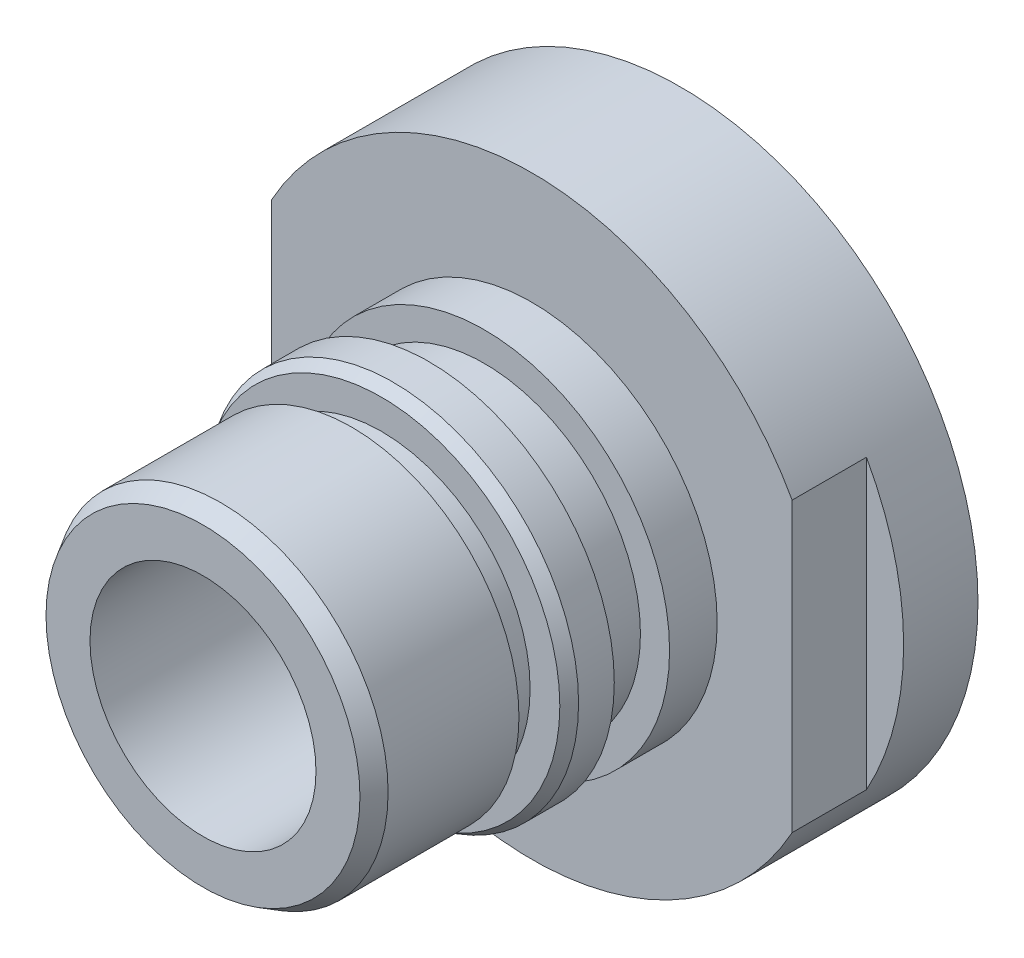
ISO-10303-21;
HEADER;
FILE_DESCRIPTION(('STEP AP214'),'2;1');
FILE_NAME('part.step','',(''),(''),'','','');
FILE_SCHEMA(('AUTOMOTIVE_DESIGN { 1 0 10303 214 1 1 1 1 }'));
ENDSEC;
DATA;
#1=APPLICATION_CONTEXT('core data for automotive mechanical design processes');
#2=APPLICATION_PROTOCOL_DEFINITION('international standard','automotive_design',2000,#1);
#3=PRODUCT_CONTEXT('',#1,'mechanical');
#4=PRODUCT('Part','Part','',(#3));
#5=PRODUCT_RELATED_PRODUCT_CATEGORY('part','',(#4));
#6=PRODUCT_DEFINITION_FORMATION('','',#4);
#7=PRODUCT_DEFINITION_CONTEXT('part definition',#1,'design');
#8=PRODUCT_DEFINITION('design','',#6,#7);
#9=PRODUCT_DEFINITION_SHAPE('','',#8);
#10=(LENGTH_UNIT() NAMED_UNIT(*) SI_UNIT(.MILLI.,.METRE.));
#11=(NAMED_UNIT(*) PLANE_ANGLE_UNIT() SI_UNIT($,.RADIAN.));
#12=(NAMED_UNIT(*) SI_UNIT($,.STERADIAN.) SOLID_ANGLE_UNIT());
#13=UNCERTAINTY_MEASURE_WITH_UNIT(LENGTH_MEASURE(1.E-05),#10,'distance_accuracy_value','');
#14=(GEOMETRIC_REPRESENTATION_CONTEXT(3) GLOBAL_UNCERTAINTY_ASSIGNED_CONTEXT((#13)) GLOBAL_UNIT_ASSIGNED_CONTEXT((#10,
#11,#12)) REPRESENTATION_CONTEXT('',''));
#15=CARTESIAN_POINT('',(0.,0.,0.));
#16=DIRECTION('',(0.,0.,1.));
#17=DIRECTION('',(1.,0.,0.));
#18=AXIS2_PLACEMENT_3D('',#15,#16,#17);
#19=CARTESIAN_POINT('',(0.,0.,0.));
#20=DIRECTION('',(0.,0.,1.));
#21=DIRECTION('',(1.,0.,0.));
#22=AXIS2_PLACEMENT_3D('',#19,#20,#21);
#23=PLANE('',#22);
#24=CARTESIAN_POINT('',(0.,0.,0.));
#25=DIRECTION('',(0.,0.,-1.));
#26=DIRECTION('',(-1.,0.,0.));
#27=AXIS2_PLACEMENT_3D('',#24,#25,#26);
#28=CIRCLE('',#27,12.6262681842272);
#29=CARTESIAN_POINT('',(-12.6262681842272,0.,0.));
#30=VERTEX_POINT('',#29);
#31=EDGE_CURVE('E167',#30,#30,#28,.F.);
#32=ORIENTED_EDGE('',*,*,#31,.T.);
#33=EDGE_LOOP('',(#32));
#34=FACE_BOUND('',#33,.T.);
#35=CARTESIAN_POINT('',(0.,0.,0.));
#36=DIRECTION('',(0.,0.,1.));
#37=DIRECTION('',(1.,0.,0.));
#38=AXIS2_PLACEMENT_3D('',#35,#36,#37);
#39=CIRCLE('',#38,12.7);
#40=CARTESIAN_POINT('',(12.7,0.,0.));
#41=VERTEX_POINT('',#40);
#42=EDGE_CURVE('E91',#41,#41,#39,.T.);
#43=ORIENTED_EDGE('',*,*,#42,.F.);
#44=EDGE_LOOP('',(#43));
#45=FACE_BOUND('',#44,.T.);
#46=ADVANCED_FACE('F31',(#34,#45),#23,.F.);
#47=CARTESIAN_POINT('',(0.,0.,12.7762));
#48=DIRECTION('',(0.,0.,1.));
#49=DIRECTION('',(1.,0.,0.));
#50=AXIS2_PLACEMENT_3D('',#47,#48,#49);
#51=PLANE('',#50);
#52=CARTESIAN_POINT('',(0.,0.,12.7762));
#53=DIRECTION('',(0.,0.,1.));
#54=DIRECTION('',(1.,0.,0.));
#55=AXIS2_PLACEMENT_3D('',#52,#53,#54);
#56=CIRCLE('',#55,7.61880606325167);
#57=CARTESIAN_POINT('',(7.61880606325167,0.,12.7762));
#58=VERTEX_POINT('',#57);
#59=EDGE_CURVE('E109',#58,#58,#56,.T.);
#60=ORIENTED_EDGE('',*,*,#59,.T.);
#61=EDGE_LOOP('',(#60));
#62=FACE_BOUND('',#61,.T.);
#63=CARTESIAN_POINT('',(0.,0.,12.7762));
#64=DIRECTION('',(0.,0.,1.));
#65=DIRECTION('',(1.,0.,0.));
#66=AXIS2_PLACEMENT_3D('',#63,#64,#65);
#67=CIRCLE('',#66,6.35);
#68=CARTESIAN_POINT('',(6.35,0.,12.7762));
#69=VERTEX_POINT('',#68);
#70=EDGE_CURVE('E170',#69,#69,#67,.T.);
#71=ORIENTED_EDGE('',*,*,#70,.F.);
#72=EDGE_LOOP('',(#71));
#73=FACE_BOUND('',#72,.T.);
#74=ADVANCED_FACE('F192',(#62,#73),#51,.T.);
#75=CARTESIAN_POINT('',(0.,0.,8.382));
#76=DIRECTION('',(0.,0.,1.));
#77=DIRECTION('',(1.,0.,0.));
#78=AXIS2_PLACEMENT_3D('',#75,#76,#77);
#79=PLANE('',#78);
#80=CARTESIAN_POINT('',(0.,0.,8.382));
#81=DIRECTION('',(0.,0.,1.));
#82=DIRECTION('',(1.,0.,0.));
#83=AXIS2_PLACEMENT_3D('',#80,#81,#82);
#84=CIRCLE('',#83,7.9121);
#85=CARTESIAN_POINT('',(7.9121,0.,8.382));
#86=VERTEX_POINT('',#85);
#87=EDGE_CURVE('E95',#86,#86,#84,.T.);
#88=ORIENTED_EDGE('',*,*,#87,.T.);
#89=EDGE_LOOP('',(#88));
#90=FACE_BOUND('',#89,.T.);
#91=CARTESIAN_POINT('',(0.,0.,8.382));
#92=DIRECTION('',(0.,0.,1.));
#93=DIRECTION('',(1.,0.,0.));
#94=AXIS2_PLACEMENT_3D('',#91,#92,#93);
#95=CIRCLE('',#94,6.6675);
#96=CARTESIAN_POINT('',(6.6675,0.,8.382));
#97=VERTEX_POINT('',#96);
#98=EDGE_CURVE('E388',#97,#97,#95,.T.);
#99=ORIENTED_EDGE('',*,*,#98,.F.);
#100=EDGE_LOOP('',(#99));
#101=FACE_BOUND('',#100,.T.);
#102=ADVANCED_FACE('F200',(#90,#101),#79,.T.);
#103=CARTESIAN_POINT('',(0.,0.,6.35));
#104=DIRECTION('',(0.,0.,1.));
#105=DIRECTION('',(1.,0.,0.));
#106=AXIS2_PLACEMENT_3D('',#103,#104,#105);
#107=PLANE('',#106);
#108=DIRECTION('',(0.,-1.,0.));
#109=VECTOR('',#108,1.);
#110=CARTESIAN_POINT('',(11.1125,11.1125,6.35));
#111=LINE('',#110,#109);
#112=CARTESIAN_POINT('',(11.1125,6.14836106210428,6.35));
#113=VERTEX_POINT('',#112);
#114=CARTESIAN_POINT('',(11.1125,-6.14836106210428,6.35));
#115=VERTEX_POINT('',#114);
#116=EDGE_CURVE('E72',#113,#115,#111,.T.);
#117=ORIENTED_EDGE('',*,*,#116,.F.);
#118=CARTESIAN_POINT('',(0.,0.,6.35));
#119=DIRECTION('',(0.,0.,1.));
#120=DIRECTION('',(1.,0.,0.));
#121=AXIS2_PLACEMENT_3D('',#118,#119,#120);
#122=CIRCLE('',#121,12.7);
#123=CARTESIAN_POINT('',(-11.1125,6.14836106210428,6.35));
#124=VERTEX_POINT('',#123);
#125=EDGE_CURVE('E82',#113,#124,#122,.T.);
#126=ORIENTED_EDGE('',*,*,#125,.T.);
#127=DIRECTION('',(0.,1.,0.));
#128=VECTOR('',#127,1.);
#129=CARTESIAN_POINT('',(-11.1125,11.1125,6.35));
#130=LINE('',#129,#128);
#131=CARTESIAN_POINT('',(-11.1125,-6.14836106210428,6.35));
#132=VERTEX_POINT('',#131);
#133=EDGE_CURVE('E988',#132,#124,#130,.T.);
#134=ORIENTED_EDGE('',*,*,#133,.F.);
#135=EDGE_CURVE('E85',#132,#115,#122,.T.);
#136=ORIENTED_EDGE('',*,*,#135,.T.);
#137=EDGE_LOOP('',(#117,#126,#134,#136));
#138=FACE_BOUND('',#137,.T.);
#139=CARTESIAN_POINT('',(0.,0.,6.35));
#140=DIRECTION('',(0.,0.,1.));
#141=DIRECTION('',(1.,0.,0.));
#142=AXIS2_PLACEMENT_3D('',#139,#140,#141);
#143=CIRCLE('',#142,7.9121);
#144=CARTESIAN_POINT('',(7.9121,0.,6.35));
#145=VERTEX_POINT('',#144);
#146=EDGE_CURVE('E394',#145,#145,#143,.T.);
#147=ORIENTED_EDGE('',*,*,#146,.F.);
#148=EDGE_LOOP('',(#147));
#149=FACE_BOUND('',#148,.T.);
#150=ADVANCED_FACE('F79',(#138,#149),#107,.T.);
#151=CARTESIAN_POINT('',(0.,0.,6.35));
#152=DIRECTION('',(0.,0.,-1.));
#153=DIRECTION('',(-1.,0.,0.));
#154=AXIS2_PLACEMENT_3D('',#151,#152,#153);
#155=CYLINDRICAL_SURFACE('',#154,12.7);
#156=ORIENTED_EDGE('',*,*,#125,.F.);
#157=DIRECTION('',(0.,0.,-1.));
#158=VECTOR('',#157,1.);
#159=CARTESIAN_POINT('',(11.1125,6.14836106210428,6.35));
#160=LINE('',#159,#158);
#161=CARTESIAN_POINT('',(11.1125,6.14836106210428,3.175));
#162=VERTEX_POINT('',#161);
#163=EDGE_CURVE('E11',#113,#162,#160,.T.);
#164=ORIENTED_EDGE('',*,*,#163,.T.);
#165=CARTESIAN_POINT('',(0.,0.,3.175));
#166=DIRECTION('',(0.,0.,1.));
#167=DIRECTION('',(1.,0.,0.));
#168=AXIS2_PLACEMENT_3D('',#165,#166,#167);
#169=CIRCLE('',#168,12.7);
#170=CARTESIAN_POINT('',(11.1125,-6.14836106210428,3.175));
#171=VERTEX_POINT('',#170);
#172=EDGE_CURVE('E182',#171,#162,#169,.T.);
#173=ORIENTED_EDGE('',*,*,#172,.F.);
#174=DIRECTION('',(0.,0.,-1.));
#175=VECTOR('',#174,1.);
#176=CARTESIAN_POINT('',(11.1125,-6.14836106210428,6.35));
#177=LINE('',#176,#175);
#178=EDGE_CURVE('E39',#171,#115,#177,.F.);
#179=ORIENTED_EDGE('',*,*,#178,.T.);
#180=ORIENTED_EDGE('',*,*,#135,.F.);
#181=DIRECTION('',(0.,0.,-1.));
#182=VECTOR('',#181,1.);
#183=CARTESIAN_POINT('',(-11.1125,-6.14836106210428,6.35));
#184=LINE('',#183,#182);
#185=CARTESIAN_POINT('',(-11.1125,-6.14836106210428,3.175));
#186=VERTEX_POINT('',#185);
#187=EDGE_CURVE('E179',#132,#186,#184,.T.);
#188=ORIENTED_EDGE('',*,*,#187,.T.);
#189=CARTESIAN_POINT('',(0.,0.,3.175));
#190=DIRECTION('',(0.,0.,1.));
#191=DIRECTION('',(1.,0.,0.));
#192=AXIS2_PLACEMENT_3D('',#189,#190,#191);
#193=CIRCLE('',#192,12.7);
#194=CARTESIAN_POINT('',(-11.1125,6.14836106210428,3.175));
#195=VERTEX_POINT('',#194);
#196=EDGE_CURVE('E176',#195,#186,#193,.T.);
#197=ORIENTED_EDGE('',*,*,#196,.F.);
#198=DIRECTION('',(0.,0.,-1.));
#199=VECTOR('',#198,1.);
#200=CARTESIAN_POINT('',(-11.1125,6.14836106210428,6.35));
#201=LINE('',#200,#199);
#202=EDGE_CURVE('E90',#195,#124,#201,.F.);
#203=ORIENTED_EDGE('',*,*,#202,.T.);
#204=EDGE_LOOP('',(#156,#164,#173,#179,#180,#188,#197,#203));
#205=FACE_BOUND('',#204,.T.);
#206=ORIENTED_EDGE('',*,*,#42,.T.);
#207=EDGE_LOOP('',(#206));
#208=FACE_BOUND('',#207,.T.);
#209=ADVANCED_FACE('F33',(#205,#208),#155,.T.);
#210=CARTESIAN_POINT('',(0.,0.,8.382));
#211=DIRECTION('',(0.,0.,-1.));
#212=DIRECTION('',(-1.,0.,0.));
#213=AXIS2_PLACEMENT_3D('',#210,#211,#212);
#214=CYLINDRICAL_SURFACE('',#213,7.9121);
#215=ORIENTED_EDGE('',*,*,#87,.F.);
#216=EDGE_LOOP('',(#215));
#217=FACE_BOUND('',#216,.T.);
#218=ORIENTED_EDGE('',*,*,#146,.T.);
#219=EDGE_LOOP('',(#218));
#220=FACE_BOUND('',#219,.T.);
#221=ADVANCED_FACE('F401',(#217,#220),#214,.T.);
#222=CARTESIAN_POINT('',(0.,0.,10.7442));
#223=DIRECTION('',(0.,0.,-1.));
#224=DIRECTION('',(-1.,0.,0.));
#225=AXIS2_PLACEMENT_3D('',#222,#223,#224);
#226=CYLINDRICAL_SURFACE('',#225,6.6675);
#227=CARTESIAN_POINT('',(0.,0.,10.7442));
#228=DIRECTION('',(0.,0.,1.));
#229=DIRECTION('',(1.,0.,0.));
#230=AXIS2_PLACEMENT_3D('',#227,#228,#229);
#231=CIRCLE('',#230,6.6675);
#232=CARTESIAN_POINT('',(6.6675,0.,10.7442));
#233=VERTEX_POINT('',#232);
#234=EDGE_CURVE('E391',#233,#233,#231,.T.);
#235=ORIENTED_EDGE('',*,*,#234,.F.);
#236=EDGE_LOOP('',(#235));
#237=FACE_BOUND('',#236,.T.);
#238=ORIENTED_EDGE('',*,*,#98,.T.);
#239=EDGE_LOOP('',(#238));
#240=FACE_BOUND('',#239,.T.);
#241=ADVANCED_FACE('F404',(#237,#240),#226,.T.);
#242=CARTESIAN_POINT('',(0.,0.,10.7442));
#243=DIRECTION('',(0.,0.,1.));
#244=DIRECTION('',(1.,0.,0.));
#245=AXIS2_PLACEMENT_3D('',#242,#243,#244);
#246=PLANE('',#245);
#247=CARTESIAN_POINT('',(0.,0.,10.7442));
#248=DIRECTION('',(0.,0.,1.));
#249=DIRECTION('',(1.,0.,0.));
#250=AXIS2_PLACEMENT_3D('',#247,#248,#249);
#251=CIRCLE('',#250,7.9121);
#252=CARTESIAN_POINT('',(7.9121,0.,10.7442));
#253=VERTEX_POINT('',#252);
#254=EDGE_CURVE('E385',#253,#253,#251,.T.);
#255=ORIENTED_EDGE('',*,*,#254,.F.);
#256=EDGE_LOOP('',(#255));
#257=FACE_BOUND('',#256,.T.);
#258=ORIENTED_EDGE('',*,*,#234,.T.);
#259=EDGE_LOOP('',(#258));
#260=FACE_BOUND('',#259,.T.);
#261=ADVANCED_FACE('F417',(#257,#260),#246,.F.);
#262=CARTESIAN_POINT('',(0.,0.,12.7762));
#263=DIRECTION('',(0.,0.,-1.));
#264=DIRECTION('',(-1.,0.,0.));
#265=AXIS2_PLACEMENT_3D('',#262,#263,#264);
#266=CYLINDRICAL_SURFACE('',#265,7.9121);
#267=CARTESIAN_POINT('',(0.,0.,12.2682));
#268=DIRECTION('',(0.,0.,1.));
#269=DIRECTION('',(1.,0.,0.));
#270=AXIS2_PLACEMENT_3D('',#267,#268,#269);
#271=CIRCLE('',#270,7.9121);
#272=CARTESIAN_POINT('',(7.9121,0.,12.2682));
#273=VERTEX_POINT('',#272);
#274=EDGE_CURVE('E173',#273,#273,#271,.F.);
#275=ORIENTED_EDGE('',*,*,#274,.T.);
#276=EDGE_LOOP('',(#275));
#277=FACE_BOUND('',#276,.T.);
#278=ORIENTED_EDGE('',*,*,#254,.T.);
#279=EDGE_LOOP('',(#278));
#280=FACE_BOUND('',#279,.T.);
#281=ADVANCED_FACE('F419',(#277,#280),#266,.T.);
#282=CARTESIAN_POINT('',(0.,0.,20.3962));
#283=DIRECTION('',(0.,0.,-1.));
#284=DIRECTION('',(-1.,0.,0.));
#285=AXIS2_PLACEMENT_3D('',#282,#283,#284);
#286=CYLINDRICAL_SURFACE('',#285,7.14375);
#287=CARTESIAN_POINT('',(0.,0.,14.0462));
#288=DIRECTION('',(0.,0.,1.));
#289=DIRECTION('',(1.,0.,0.));
#290=AXIS2_PLACEMENT_3D('',#287,#288,#289);
#291=CIRCLE('',#290,7.14375);
#292=CARTESIAN_POINT('',(-7.14375,0.,14.0462));
#293=VERTEX_POINT('',#292);
#294=EDGE_CURVE('E110',#293,#293,#291,.T.);
#295=CARTESIAN_POINT('',(0.,0.,19.6342));
#296=DIRECTION('',(0.,0.,1.));
#297=DIRECTION('',(1.,0.,0.));
#298=AXIS2_PLACEMENT_3D('',#295,#296,#297);
#299=CIRCLE('',#298,7.14375);
#300=CARTESIAN_POINT('',(-7.14375,0.,19.6342));
#301=VERTEX_POINT('',#300);
#302=EDGE_CURVE('E106',#301,#301,#299,.F.);
#303=CARTESIAN_POINT('',(-7.14375,0.,14.0462));
#304=CARTESIAN_POINT('',(-7.14375,0.,14.1044083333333));
#305=CARTESIAN_POINT('',(-7.14375,0.,14.1626166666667));
#306=CARTESIAN_POINT('',(-7.14375,0.,14.2790333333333));
#307=CARTESIAN_POINT('',(-7.14375,0.,14.3372416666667));
#308=CARTESIAN_POINT('',(-7.14375,0.,14.4536583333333));
#309=CARTESIAN_POINT('',(-7.14375,0.,14.5118666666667));
#310=CARTESIAN_POINT('',(-7.14375,0.,14.6282833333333));
#311=CARTESIAN_POINT('',(-7.14375,0.,14.6864916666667));
#312=CARTESIAN_POINT('',(-7.14375,0.,14.8029083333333));
#313=CARTESIAN_POINT('',(-7.14375,0.,14.8611166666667));
#314=CARTESIAN_POINT('',(-7.14375,0.,14.9775333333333));
#315=CARTESIAN_POINT('',(-7.14375,0.,15.0357416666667));
#316=CARTESIAN_POINT('',(-7.14375,0.,15.1521583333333));
#317=CARTESIAN_POINT('',(-7.14375,0.,15.2103666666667));
#318=CARTESIAN_POINT('',(-7.14375,0.,15.3267833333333));
#319=CARTESIAN_POINT('',(-7.14375,0.,15.3849916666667));
#320=CARTESIAN_POINT('',(-7.14375,0.,15.5014083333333));
#321=CARTESIAN_POINT('',(-7.14375,0.,15.5596166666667));
#322=CARTESIAN_POINT('',(-7.14375,0.,15.6760333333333));
#323=CARTESIAN_POINT('',(-7.14375,0.,15.7342416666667));
#324=CARTESIAN_POINT('',(-7.14375,0.,15.8506583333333));
#325=CARTESIAN_POINT('',(-7.14375,0.,15.9088666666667));
#326=CARTESIAN_POINT('',(-7.14375,0.,16.0252833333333));
#327=CARTESIAN_POINT('',(-7.14375,0.,16.0834916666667));
#328=CARTESIAN_POINT('',(-7.14375,0.,16.1999083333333));
#329=CARTESIAN_POINT('',(-7.14375,0.,16.2581166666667));
#330=CARTESIAN_POINT('',(-7.14375,0.,16.3745333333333));
#331=CARTESIAN_POINT('',(-7.14375,0.,16.4327416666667));
#332=CARTESIAN_POINT('',(-7.14375,0.,16.5491583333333));
#333=CARTESIAN_POINT('',(-7.14375,0.,16.6073666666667));
#334=CARTESIAN_POINT('',(-7.14375,0.,16.7237833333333));
#335=CARTESIAN_POINT('',(-7.14375,0.,16.7819916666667));
#336=CARTESIAN_POINT('',(-7.14375,0.,16.8984083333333));
#337=CARTESIAN_POINT('',(-7.14375,0.,16.9566166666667));
#338=CARTESIAN_POINT('',(-7.14375,0.,17.0730333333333));
#339=CARTESIAN_POINT('',(-7.14375,0.,17.1312416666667));
#340=CARTESIAN_POINT('',(-7.14375,0.,17.2476583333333));
#341=CARTESIAN_POINT('',(-7.14375,0.,17.3058666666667));
#342=CARTESIAN_POINT('',(-7.14375,0.,17.4222833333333));
#343=CARTESIAN_POINT('',(-7.14375,0.,17.4804916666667));
#344=CARTESIAN_POINT('',(-7.14375,0.,17.5969083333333));
#345=CARTESIAN_POINT('',(-7.14375,0.,17.6551166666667));
#346=CARTESIAN_POINT('',(-7.14375,0.,17.7715333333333));
#347=CARTESIAN_POINT('',(-7.14375,0.,17.8297416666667));
#348=CARTESIAN_POINT('',(-7.14375,0.,17.9461583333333));
#349=CARTESIAN_POINT('',(-7.14375,0.,18.0043666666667));
#350=CARTESIAN_POINT('',(-7.14375,0.,18.1207833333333));
#351=CARTESIAN_POINT('',(-7.14375,0.,18.1789916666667));
#352=CARTESIAN_POINT('',(-7.14375,0.,18.2954083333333));
#353=CARTESIAN_POINT('',(-7.14375,0.,18.3536166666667));
#354=CARTESIAN_POINT('',(-7.14375,0.,18.4700333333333));
#355=CARTESIAN_POINT('',(-7.14375,0.,18.5282416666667));
#356=CARTESIAN_POINT('',(-7.14375,0.,18.6446583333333));
#357=CARTESIAN_POINT('',(-7.14375,0.,18.7028666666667));
#358=CARTESIAN_POINT('',(-7.14375,0.,18.8192833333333));
#359=CARTESIAN_POINT('',(-7.14375,0.,18.8774916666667));
#360=CARTESIAN_POINT('',(-7.14375,0.,18.9939083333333));
#361=CARTESIAN_POINT('',(-7.14375,0.,19.0521166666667));
#362=CARTESIAN_POINT('',(-7.14375,0.,19.1685333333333));
#363=CARTESIAN_POINT('',(-7.14375,0.,19.2267416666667));
#364=CARTESIAN_POINT('',(-7.14375,0.,19.3431583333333));
#365=CARTESIAN_POINT('',(-7.14375,0.,19.4013666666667));
#366=CARTESIAN_POINT('',(-7.14375,0.,19.5177833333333));
#367=CARTESIAN_POINT('',(-7.14375,0.,19.5759916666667));
#368=CARTESIAN_POINT('',(-7.14375,0.,19.6342));
#369=B_SPLINE_CURVE_WITH_KNOTS('',3,(#303,#304,#305,#306,#307,#308,#309,#310,#311,#312,#313,
#314,#315,#316,#317,#318,#319,#320,#321,#322,#323,#324,#325,#326,#327,#328,#329,#330,#331,#332,
#333,#334,#335,#336,#337,#338,#339,#340,#341,#342,#343,#344,#345,#346,#347,#348,#349,#350,#351,
#352,#353,#354,#355,#356,#357,#358,#359,#360,#361,#362,#363,#364,#365,#366,#367,#368),
.UNSPECIFIED.,.F.,.F.,(4,2,2,2,2,2,2,2,2,2,2,2,2,2,2,2,2,2,2,2,2,2,2,2,2,2,2,2,2,2,2,2,4),(0.,
0.174624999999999,0.349249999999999,0.523875,0.698499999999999,0.873124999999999,1.04775,
1.222375,1.397,1.571625,1.74625,1.920875,2.0955,2.270125,2.44475,2.619375,2.794,2.968625,
3.14325,3.317875,3.4925,3.667125,3.84175,4.016375,4.191,4.365625,4.54025,4.714875,4.8895,
5.064125,5.23875,5.413375,5.588),.UNSPECIFIED.);
#370=EDGE_CURVE('BSEAM421',#293,#301,#369,.T.);
#371=ORIENTED_EDGE('',*,*,#294,.T.);
#372=ORIENTED_EDGE('',*,*,#302,.T.);
#373=ORIENTED_EDGE('',*,*,#370,.T.);
#374=ORIENTED_EDGE('',*,*,#370,.F.);
#375=EDGE_LOOP('',(#371,#373,#372,#374));
#376=FACE_BOUND('',#375,.T.);
#377=ADVANCED_FACE('F421',(#376),#286,.T.);
#378=CARTESIAN_POINT('',(0.,0.,20.3962));
#379=DIRECTION('',(0.,0.,1.));
#380=DIRECTION('',(1.,0.,0.));
#381=AXIS2_PLACEMENT_3D('',#378,#379,#380);
#382=PLANE('',#381);
#383=CARTESIAN_POINT('',(0.,0.,20.3962));
#384=DIRECTION('',(0.,0.,1.));
#385=DIRECTION('',(1.,0.,0.));
#386=AXIS2_PLACEMENT_3D('',#383,#384,#385);
#387=CIRCLE('',#386,6.70380909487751);
#388=CARTESIAN_POINT('',(6.70380909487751,0.,20.3962));
#389=VERTEX_POINT('',#388);
#390=EDGE_CURVE('E93',#389,#389,#387,.T.);
#391=ORIENTED_EDGE('',*,*,#390,.T.);
#392=EDGE_LOOP('',(#391));
#393=FACE_BOUND('',#392,.T.);
#394=CARTESIAN_POINT('',(0.,0.,20.3962));
#395=DIRECTION('',(0.,0.,1.));
#396=DIRECTION('',(1.,0.,0.));
#397=AXIS2_PLACEMENT_3D('',#394,#395,#396);
#398=CIRCLE('',#397,4.826);
#399=CARTESIAN_POINT('',(4.826,0.,20.3962));
#400=VERTEX_POINT('',#399);
#401=EDGE_CURVE('E99',#400,#400,#398,.T.);
#402=ORIENTED_EDGE('',*,*,#401,.F.);
#403=EDGE_LOOP('',(#402));
#404=FACE_BOUND('',#403,.T.);
#405=ADVANCED_FACE('F429',(#393,#404),#382,.T.);
#406=CARTESIAN_POINT('',(0.,0.,7.62));
#407=DIRECTION('',(0.,0.,-1.));
#408=DIRECTION('',(-1.,0.,0.));
#409=AXIS2_PLACEMENT_3D('',#406,#407,#408);
#410=CYLINDRICAL_SURFACE('',#409,5.5753);
#411=CARTESIAN_POINT('',(0.,0.,0.114300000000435));
#412=DIRECTION('',(0.,0.,1.));
#413=DIRECTION('',(1.,0.,0.));
#414=AXIS2_PLACEMENT_3D('',#411,#412,#413);
#415=CIRCLE('',#414,5.5753);
#416=CARTESIAN_POINT('',(-5.5753,0.,0.114300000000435));
#417=VERTEX_POINT('',#416);
#418=EDGE_CURVE('E115',#417,#417,#415,.F.);
#419=CARTESIAN_POINT('',(0.,0.,7.62));
#420=DIRECTION('',(0.,0.,-1.));
#421=DIRECTION('',(-1.,0.,0.));
#422=AXIS2_PLACEMENT_3D('',#419,#420,#421);
#423=CIRCLE('',#422,5.5753);
#424=CARTESIAN_POINT('',(-5.5753,0.,7.62));
#425=VERTEX_POINT('',#424);
#426=EDGE_CURVE('E382',#425,#425,#423,.T.);
#427=CARTESIAN_POINT('',(-5.5753,0.,0.114300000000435));
#428=CARTESIAN_POINT('',(-5.5753,0.,0.19248437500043));
#429=CARTESIAN_POINT('',(-5.5753,0.,0.270668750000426));
#430=CARTESIAN_POINT('',(-5.5753,0.,0.427037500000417));
#431=CARTESIAN_POINT('',(-5.5753,0.,0.505221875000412));
#432=CARTESIAN_POINT('',(-5.5753,0.,0.661590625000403));
#433=CARTESIAN_POINT('',(-5.5753,0.,0.739775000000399));
#434=CARTESIAN_POINT('',(-5.5753,0.,0.89614375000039));
#435=CARTESIAN_POINT('',(-5.5753,0.,0.974328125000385));
#436=CARTESIAN_POINT('',(-5.5753,0.,1.13069687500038));
#437=CARTESIAN_POINT('',(-5.5753,0.,1.20888125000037));
#438=CARTESIAN_POINT('',(-5.5753,0.,1.36525000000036));
#439=CARTESIAN_POINT('',(-5.5753,0.,1.44343437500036));
#440=CARTESIAN_POINT('',(-5.5753,0.,1.59980312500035));
#441=CARTESIAN_POINT('',(-5.5753,0.,1.67798750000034));
#442=CARTESIAN_POINT('',(-5.5753,0.,1.83435625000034));
#443=CARTESIAN_POINT('',(-5.5753,0.,1.91254062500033));
#444=CARTESIAN_POINT('',(-5.5753,0.,2.06890937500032));
#445=CARTESIAN_POINT('',(-5.5753,0.,2.14709375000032));
#446=CARTESIAN_POINT('',(-5.5753,0.,2.30346250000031));
#447=CARTESIAN_POINT('',(-5.5753,0.,2.3816468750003));
#448=CARTESIAN_POINT('',(-5.5753,0.,2.53801562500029));
#449=CARTESIAN_POINT('',(-5.5753,0.,2.61620000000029));
#450=CARTESIAN_POINT('',(-5.5753,0.,2.77256875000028));
#451=CARTESIAN_POINT('',(-5.5753,0.,2.85075312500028));
#452=CARTESIAN_POINT('',(-5.5753,0.,3.00712187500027));
#453=CARTESIAN_POINT('',(-5.5753,0.,3.08530625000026));
#454=CARTESIAN_POINT('',(-5.5753,0.,3.24167500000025));
#455=CARTESIAN_POINT('',(-5.5753,0.,3.31985937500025));
#456=CARTESIAN_POINT('',(-5.5753,0.,3.47622812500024));
#457=CARTESIAN_POINT('',(-5.5753,0.,3.55441250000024));
#458=CARTESIAN_POINT('',(-5.5753,0.,3.71078125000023));
#459=CARTESIAN_POINT('',(-5.5753,0.,3.78896562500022));
#460=CARTESIAN_POINT('',(-5.5753,0.,3.94533437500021));
#461=CARTESIAN_POINT('',(-5.5753,0.,4.02351875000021));
#462=CARTESIAN_POINT('',(-5.5753,0.,4.1798875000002));
#463=CARTESIAN_POINT('',(-5.5753,0.,4.2580718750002));
#464=CARTESIAN_POINT('',(-5.5753,0.,4.41444062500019));
#465=CARTESIAN_POINT('',(-5.5753,0.,4.49262500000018));
#466=CARTESIAN_POINT('',(-5.5753,0.,4.64899375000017));
#467=CARTESIAN_POINT('',(-5.5753,0.,4.72717812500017));
#468=CARTESIAN_POINT('',(-5.5753,0.,4.88354687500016));
#469=CARTESIAN_POINT('',(-5.5753,0.,4.96173125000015));
#470=CARTESIAN_POINT('',(-5.5753,0.,5.11810000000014));
#471=CARTESIAN_POINT('',(-5.5753,0.,5.19628437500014));
#472=CARTESIAN_POINT('',(-5.5753,0.,5.35265312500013));
#473=CARTESIAN_POINT('',(-5.5753,0.,5.43083750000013));
#474=CARTESIAN_POINT('',(-5.5753,0.,5.58720625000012));
#475=CARTESIAN_POINT('',(-5.5753,0.,5.66539062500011));
#476=CARTESIAN_POINT('',(-5.5753,0.,5.8217593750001));
#477=CARTESIAN_POINT('',(-5.5753,0.,5.8999437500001));
#478=CARTESIAN_POINT('',(-5.5753,0.,6.05631250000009));
#479=CARTESIAN_POINT('',(-5.5753,0.,6.13449687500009));
#480=CARTESIAN_POINT('',(-5.5753,0.,6.29086562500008));
#481=CARTESIAN_POINT('',(-5.5753,0.,6.36905000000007));
#482=CARTESIAN_POINT('',(-5.5753,0.,6.52541875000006));
#483=CARTESIAN_POINT('',(-5.5753,0.,6.60360312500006));
#484=CARTESIAN_POINT('',(-5.5753,0.,6.75997187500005));
#485=CARTESIAN_POINT('',(-5.5753,0.,6.83815625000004));
#486=CARTESIAN_POINT('',(-5.5753,0.,6.99452500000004));
#487=CARTESIAN_POINT('',(-5.5753,0.,7.07270937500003));
#488=CARTESIAN_POINT('',(-5.5753,0.,7.22907812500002));
#489=CARTESIAN_POINT('',(-5.5753,0.,7.30726250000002));
#490=CARTESIAN_POINT('',(-5.5753,0.,7.46363125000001));
#491=CARTESIAN_POINT('',(-5.5753,0.,7.541815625));
#492=CARTESIAN_POINT('',(-5.5753,0.,7.62));
#493=B_SPLINE_CURVE_WITH_KNOTS('',3,(#427,#428,#429,#430,#431,#432,#433,#434,#435,#436,#437,
#438,#439,#440,#441,#442,#443,#444,#445,#446,#447,#448,#449,#450,#451,#452,#453,#454,#455,#456,
#457,#458,#459,#460,#461,#462,#463,#464,#465,#466,#467,#468,#469,#470,#471,#472,#473,#474,#475,
#476,#477,#478,#479,#480,#481,#482,#483,#484,#485,#486,#487,#488,#489,#490,#491,#492),
.UNSPECIFIED.,.F.,.F.,(4,2,2,2,2,2,2,2,2,2,2,2,2,2,2,2,2,2,2,2,2,2,2,2,2,2,2,2,2,2,2,2,4),(0.,
0.234553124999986,0.469106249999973,0.70365937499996,0.938212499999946,1.17276562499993,
1.40731874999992,1.64187187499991,1.87642499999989,2.11097812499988,2.34553124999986,
2.58008437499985,2.81463749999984,3.04919062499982,3.28374374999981,3.5182968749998,
3.75284999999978,3.98740312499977,4.22195624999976,4.45650937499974,4.69106249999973,
4.92561562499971,5.1601687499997,5.39472187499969,5.62927499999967,5.86382812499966,
6.09838124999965,6.33293437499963,6.56748749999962,6.80204062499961,7.03659374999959,
7.27114687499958,7.50569999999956),.UNSPECIFIED.);
#494=EDGE_CURVE('BSEAM433',#417,#425,#493,.T.);
#495=ORIENTED_EDGE('',*,*,#418,.T.);
#496=ORIENTED_EDGE('',*,*,#426,.F.);
#497=ORIENTED_EDGE('',*,*,#494,.T.);
#498=ORIENTED_EDGE('',*,*,#494,.F.);
#499=EDGE_LOOP('',(#495,#497,#496,#498));
#500=FACE_BOUND('',#499,.T.);
#501=ADVANCED_FACE('F433',(#500),#410,.F.);
#502=CARTESIAN_POINT('',(0.,0.,7.62));
#503=DIRECTION('',(0.,0.,-1.));
#504=DIRECTION('',(-1.,0.,0.));
#505=AXIS2_PLACEMENT_3D('',#502,#503,#504);
#506=PLANE('',#505);
#507=CARTESIAN_POINT('',(0.,0.,7.62));
#508=DIRECTION('',(0.,0.,-1.));
#509=DIRECTION('',(-1.,0.,0.));
#510=AXIS2_PLACEMENT_3D('',#507,#508,#509);
#511=CIRCLE('',#510,3.175);
#512=CARTESIAN_POINT('',(-3.175,0.,7.62));
#513=VERTEX_POINT('',#512);
#514=EDGE_CURVE('E102',#513,#513,#511,.T.);
#515=ORIENTED_EDGE('',*,*,#514,.F.);
#516=EDGE_LOOP('',(#515));
#517=FACE_BOUND('',#516,.T.);
#518=ORIENTED_EDGE('',*,*,#426,.T.);
#519=EDGE_LOOP('',(#518));
#520=FACE_BOUND('',#519,.T.);
#521=ADVANCED_FACE('F437',(#517,#520),#506,.T.);
#522=CARTESIAN_POINT('',(0.,0.,10.16));
#523=DIRECTION('',(0.,0.,-1.));
#524=DIRECTION('',(-1.,0.,0.));
#525=AXIS2_PLACEMENT_3D('',#522,#523,#524);
#526=CYLINDRICAL_SURFACE('',#525,3.175);
#527=CARTESIAN_POINT('',(0.,0.,10.16));
#528=DIRECTION('',(0.,0.,-1.));
#529=DIRECTION('',(-1.,0.,0.));
#530=AXIS2_PLACEMENT_3D('',#527,#528,#529);
#531=CIRCLE('',#530,3.175);
#532=CARTESIAN_POINT('',(-3.175,0.,10.16));
#533=VERTEX_POINT('',#532);
#534=EDGE_CURVE('E103',#533,#533,#531,.F.);
#535=ORIENTED_EDGE('',*,*,#534,.T.);
#536=EDGE_LOOP('',(#535));
#537=FACE_BOUND('',#536,.T.);
#538=ORIENTED_EDGE('',*,*,#514,.T.);
#539=EDGE_LOOP('',(#538));
#540=FACE_BOUND('',#539,.T.);
#541=ADVANCED_FACE('F441',(#537,#540),#526,.F.);
#542=CARTESIAN_POINT('',(0.,0.,10.16));
#543=DIRECTION('',(0.,0.,-1.));
#544=DIRECTION('',(-1.,0.,0.));
#545=AXIS2_PLACEMENT_3D('',#542,#543,#544);
#546=PLANE('',#545);
#547=CARTESIAN_POINT('',(0.,0.,10.16));
#548=DIRECTION('',(0.,0.,-1.));
#549=DIRECTION('',(-1.,0.,0.));
#550=AXIS2_PLACEMENT_3D('',#547,#548,#549);
#551=CIRCLE('',#550,4.826);
#552=CARTESIAN_POINT('',(-4.826,0.,10.16));
#553=VERTEX_POINT('',#552);
#554=EDGE_CURVE('E113',#553,#553,#551,.T.);
#555=ORIENTED_EDGE('',*,*,#554,.F.);
#556=EDGE_LOOP('',(#555));
#557=FACE_BOUND('',#556,.T.);
#558=ORIENTED_EDGE('',*,*,#534,.F.);
#559=EDGE_LOOP('',(#558));
#560=FACE_BOUND('',#559,.T.);
#561=ADVANCED_FACE('F445',(#557,#560),#546,.F.);
#562=CARTESIAN_POINT('',(0.,0.,22.86));
#563=DIRECTION('',(0.,0.,-1.));
#564=DIRECTION('',(-1.,0.,0.));
#565=AXIS2_PLACEMENT_3D('',#562,#563,#564);
#566=CYLINDRICAL_SURFACE('',#565,4.826);
#567=ORIENTED_EDGE('',*,*,#401,.T.);
#568=EDGE_LOOP('',(#567));
#569=FACE_BOUND('',#568,.T.);
#570=ORIENTED_EDGE('',*,*,#554,.T.);
#571=EDGE_LOOP('',(#570));
#572=FACE_BOUND('',#571,.T.);
#573=ADVANCED_FACE('F447',(#569,#572),#566,.F.);
#574=CARTESIAN_POINT('',(0.,0.,20.3962));
#575=DIRECTION('',(0.,0.,-1.));
#576=DIRECTION('',(-1.,0.,0.));
#577=AXIS2_PLACEMENT_3D('',#574,#575,#576);
#578=CONICAL_SURFACE('',#577,6.70380909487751,0.523598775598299);
#579=ORIENTED_EDGE('',*,*,#302,.F.);
#580=EDGE_LOOP('',(#579));
#581=FACE_BOUND('',#580,.T.);
#582=ORIENTED_EDGE('',*,*,#390,.F.);
#583=EDGE_LOOP('',(#582));
#584=FACE_BOUND('',#583,.T.);
#585=ADVANCED_FACE('F450',(#581,#584),#578,.T.);
#586=CARTESIAN_POINT('',(0.,0.,14.0462));
#587=DIRECTION('',(0.,0.,1.));
#588=DIRECTION('',(1.,0.,0.));
#589=AXIS2_PLACEMENT_3D('',#586,#587,#588);
#590=PLANE('',#589);
#591=CARTESIAN_POINT('',(0.,0.,14.0462));
#592=DIRECTION('',(0.,0.,1.));
#593=DIRECTION('',(1.,0.,0.));
#594=AXIS2_PLACEMENT_3D('',#591,#592,#593);
#595=CIRCLE('',#594,6.35);
#596=CARTESIAN_POINT('',(6.35,0.,14.0462));
#597=VERTEX_POINT('',#596);
#598=EDGE_CURVE('E114',#597,#597,#595,.T.);
#599=ORIENTED_EDGE('',*,*,#598,.T.);
#600=EDGE_LOOP('',(#599));
#601=FACE_BOUND('',#600,.T.);
#602=ORIENTED_EDGE('',*,*,#294,.F.);
#603=EDGE_LOOP('',(#602));
#604=FACE_BOUND('',#603,.T.);
#605=ADVANCED_FACE('F457',(#601,#604),#590,.F.);
#606=CARTESIAN_POINT('',(0.,0.,14.0462));
#607=DIRECTION('',(0.,0.,-1.));
#608=DIRECTION('',(-1.,0.,0.));
#609=AXIS2_PLACEMENT_3D('',#606,#607,#608);
#610=CYLINDRICAL_SURFACE('',#609,6.35);
#611=ORIENTED_EDGE('',*,*,#598,.F.);
#612=EDGE_LOOP('',(#611));
#613=FACE_BOUND('',#612,.T.);
#614=ORIENTED_EDGE('',*,*,#70,.T.);
#615=EDGE_LOOP('',(#614));
#616=FACE_BOUND('',#615,.T.);
#617=ADVANCED_FACE('F461',(#613,#616),#610,.T.);
#618=CARTESIAN_POINT('',(0.,0.,0.150594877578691));
#619=DIRECTION('',(0.,0.,1.));
#620=DIRECTION('',(1.,0.,0.));
#621=AXIS2_PLACEMENT_3D('',#618,#619,#620);
#622=TOROIDAL_SURFACE('',#621,5.79119999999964,0.127);
#623=CARTESIAN_POINT('',(0.,0.,0.240397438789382));
#624=DIRECTION('',(0.,0.,1.));
#625=DIRECTION('',(1.,0.,0.));
#626=AXIS2_PLACEMENT_3D('',#623,#624,#625);
#627=CIRCLE('',#626,5.88100256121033);
#628=CARTESIAN_POINT('',(5.88100256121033,0.,0.240397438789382));
#629=VERTEX_POINT('',#628);
#630=EDGE_CURVE('E991',#629,#629,#627,.T.);
#631=ORIENTED_EDGE('',*,*,#630,.F.);
#632=EDGE_LOOP('',(#631));
#633=FACE_BOUND('',#632,.T.);
#634=CARTESIAN_POINT('',(0.,0.,0.240397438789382));
#635=DIRECTION('',(0.,0.,1.));
#636=DIRECTION('',(1.,0.,0.));
#637=AXIS2_PLACEMENT_3D('',#634,#635,#636);
#638=CIRCLE('',#637,5.70139743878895);
#639=CARTESIAN_POINT('',(5.70139743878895,0.,0.240397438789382));
#640=VERTEX_POINT('',#639);
#641=EDGE_CURVE('E987',#640,#640,#638,.T.);
#642=ORIENTED_EDGE('',*,*,#641,.T.);
#643=EDGE_LOOP('',(#642));
#644=FACE_BOUND('',#643,.T.);
#645=ADVANCED_FACE('F465',(#633,#644),#622,.F.);
#646=CARTESIAN_POINT('',(0.,0.,0.013602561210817));
#647=DIRECTION('',(0.,0.,1.));
#648=DIRECTION('',(1.,0.,0.));
#649=AXIS2_PLACEMENT_3D('',#646,#647,#648);
#650=CONICAL_SURFACE('',#649,5.47460256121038,0.785398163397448);
#651=ORIENTED_EDGE('',*,*,#641,.F.);
#652=EDGE_LOOP('',(#651));
#653=FACE_BOUND('',#652,.T.);
#654=ORIENTED_EDGE('',*,*,#418,.F.);
#655=EDGE_LOOP('',(#654));
#656=FACE_BOUND('',#655,.T.);
#657=ADVANCED_FACE('F779',(#653,#656),#650,.T.);
#658=CARTESIAN_POINT('',(0.,0.,0.240397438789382));
#659=DIRECTION('',(0.,0.,-1.));
#660=DIRECTION('',(-1.,0.,0.));
#661=AXIS2_PLACEMENT_3D('',#658,#659,#660);
#662=CONICAL_SURFACE('',#661,5.88100256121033,0.785398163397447);
#663=CARTESIAN_POINT('',(0.,0.,0.0136025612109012));
#664=DIRECTION('',(0.,0.,1.));
#665=DIRECTION('',(1.,0.,0.));
#666=AXIS2_PLACEMENT_3D('',#663,#664,#665);
#667=CIRCLE('',#666,6.10779743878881);
#668=CARTESIAN_POINT('',(6.10779743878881,0.,0.0136025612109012));
#669=VERTEX_POINT('',#668);
#670=EDGE_CURVE('E998',#669,#669,#667,.T.);
#671=ORIENTED_EDGE('',*,*,#670,.F.);
#672=EDGE_LOOP('',(#671));
#673=FACE_BOUND('',#672,.T.);
#674=ORIENTED_EDGE('',*,*,#630,.T.);
#675=EDGE_LOOP('',(#674));
#676=FACE_BOUND('',#675,.T.);
#677=ADVANCED_FACE('F222',(#673,#676),#662,.F.);
#678=CARTESIAN_POINT('',(0.,0.,0.103405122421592));
#679=DIRECTION('',(0.,0.,1.));
#680=DIRECTION('',(1.,0.,0.));
#681=AXIS2_PLACEMENT_3D('',#678,#679,#680);
#682=TOROIDAL_SURFACE('',#681,6.1975999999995,0.127);
#683=ORIENTED_EDGE('',*,*,#670,.T.);
#684=EDGE_LOOP('',(#683));
#685=FACE_BOUND('',#684,.T.);
#686=CARTESIAN_POINT('',(0.,0.,0.));
#687=DIRECTION('',(0.,0.,-1.));
#688=DIRECTION('',(-1.,0.,0.));
#689=AXIS2_PLACEMENT_3D('',#686,#687,#688);
#690=CIRCLE('',#689,6.12386818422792);
#691=CARTESIAN_POINT('',(-6.12386818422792,0.,0.));
#692=VERTEX_POINT('',#691);
#693=EDGE_CURVE('E118',#692,#692,#690,.F.);
#694=ORIENTED_EDGE('',*,*,#693,.F.);
#695=EDGE_LOOP('',(#694));
#696=FACE_BOUND('',#695,.T.);
#697=ADVANCED_FACE('F212',(#685,#696),#682,.T.);
#698=CARTESIAN_POINT('',(0.,0.,0.));
#699=DIRECTION('',(0.,0.,1.));
#700=DIRECTION('',(1.,0.,0.));
#701=AXIS2_PLACEMENT_3D('',#698,#699,#700);
#702=CIRCLE('',#701,6.27133181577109);
#703=CARTESIAN_POINT('',(6.27133181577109,0.,0.));
#704=VERTEX_POINT('',#703);
#705=EDGE_CURVE('E122',#704,#704,#702,.F.);
#706=ORIENTED_EDGE('',*,*,#705,.T.);
#707=EDGE_LOOP('',(#706));
#708=FACE_BOUND('',#707,.T.);
#709=ORIENTED_EDGE('',*,*,#693,.T.);
#710=EDGE_LOOP('',(#709));
#711=FACE_BOUND('',#710,.T.);
#712=ADVANCED_FACE('F196',(#708,#711),#23,.F.);
#713=CARTESIAN_POINT('',(0.,0.,0.240397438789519));
#714=DIRECTION('',(0.,0.,-1.));
#715=DIRECTION('',(-1.,0.,0.));
#716=AXIS2_PLACEMENT_3D('',#713,#714,#715);
#717=CONICAL_SURFACE('',#716,6.6938025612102,0.785398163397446);
#718=CARTESIAN_POINT('',(0.,0.,0.0136025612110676));
#719=DIRECTION('',(0.,0.,1.));
#720=DIRECTION('',(1.,0.,0.));
#721=AXIS2_PLACEMENT_3D('',#718,#719,#720);
#722=CIRCLE('',#721,6.92059743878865);
#723=CARTESIAN_POINT('',(6.92059743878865,0.,0.0136025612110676));
#724=VERTEX_POINT('',#723);
#725=EDGE_CURVE('E1010',#724,#724,#722,.T.);
#726=ORIENTED_EDGE('',*,*,#725,.F.);
#727=EDGE_LOOP('',(#726));
#728=FACE_BOUND('',#727,.T.);
#729=CARTESIAN_POINT('',(0.,0.,0.240397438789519));
#730=DIRECTION('',(0.,0.,1.));
#731=DIRECTION('',(1.,0.,0.));
#732=AXIS2_PLACEMENT_3D('',#729,#730,#731);
#733=CIRCLE('',#732,6.6938025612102);
#734=CARTESIAN_POINT('',(6.6938025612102,0.,0.240397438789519));
#735=VERTEX_POINT('',#734);
#736=EDGE_CURVE('E1007',#735,#735,#733,.T.);
#737=ORIENTED_EDGE('',*,*,#736,.T.);
#738=EDGE_LOOP('',(#737));
#739=FACE_BOUND('',#738,.T.);
#740=ADVANCED_FACE('F211',(#728,#739),#717,.F.);
#741=CARTESIAN_POINT('',(0.,0.,0.103405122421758));
#742=DIRECTION('',(0.,0.,1.));
#743=DIRECTION('',(1.,0.,0.));
#744=AXIS2_PLACEMENT_3D('',#741,#742,#743);
#745=TOROIDAL_SURFACE('',#744,7.01039999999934,0.127);
#746=ORIENTED_EDGE('',*,*,#725,.T.);
#747=EDGE_LOOP('',(#746));
#748=FACE_BOUND('',#747,.T.);
#749=CARTESIAN_POINT('',(0.,0.,0.));
#750=DIRECTION('',(0.,0.,-1.));
#751=DIRECTION('',(-1.,0.,0.));
#752=AXIS2_PLACEMENT_3D('',#749,#750,#751);
#753=CIRCLE('',#752,6.93666818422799);
#754=CARTESIAN_POINT('',(-6.93666818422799,0.,0.));
#755=VERTEX_POINT('',#754);
#756=EDGE_CURVE('E125',#755,#755,#753,.F.);
#757=ORIENTED_EDGE('',*,*,#756,.F.);
#758=EDGE_LOOP('',(#757));
#759=FACE_BOUND('',#758,.T.);
#760=ADVANCED_FACE('F219',(#748,#759),#745,.T.);
#761=CARTESIAN_POINT('',(0.,0.,0.150594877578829));
#762=DIRECTION('',(0.,0.,1.));
#763=DIRECTION('',(1.,0.,0.));
#764=AXIS2_PLACEMENT_3D('',#761,#762,#763);
#765=TOROIDAL_SURFACE('',#764,6.60399999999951,0.127);
#766=ORIENTED_EDGE('',*,*,#736,.F.);
#767=EDGE_LOOP('',(#766));
#768=FACE_BOUND('',#767,.T.);
#769=CARTESIAN_POINT('',(0.,0.,0.24039743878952));
#770=DIRECTION('',(0.,0.,1.));
#771=DIRECTION('',(1.,0.,0.));
#772=AXIS2_PLACEMENT_3D('',#769,#770,#771);
#773=CIRCLE('',#772,6.51419743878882);
#774=CARTESIAN_POINT('',(6.51419743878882,0.,0.24039743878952));
#775=VERTEX_POINT('',#774);
#776=EDGE_CURVE('E1004',#775,#775,#773,.T.);
#777=ORIENTED_EDGE('',*,*,#776,.T.);
#778=EDGE_LOOP('',(#777));
#779=FACE_BOUND('',#778,.T.);
#780=ADVANCED_FACE('F737',(#768,#779),#765,.F.);
#781=CARTESIAN_POINT('',(0.,0.,0.0136025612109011));
#782=DIRECTION('',(0.,0.,1.));
#783=DIRECTION('',(1.,0.,0.));
#784=AXIS2_PLACEMENT_3D('',#781,#782,#783);
#785=CONICAL_SURFACE('',#784,6.2874025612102,0.785398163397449);
#786=ORIENTED_EDGE('',*,*,#776,.F.);
#787=EDGE_LOOP('',(#786));
#788=FACE_BOUND('',#787,.T.);
#789=CARTESIAN_POINT('',(0.,0.,0.0136025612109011));
#790=DIRECTION('',(0.,0.,1.));
#791=DIRECTION('',(1.,0.,0.));
#792=AXIS2_PLACEMENT_3D('',#789,#790,#791);
#793=CIRCLE('',#792,6.2874025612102);
#794=CARTESIAN_POINT('',(6.2874025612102,0.,0.0136025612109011));
#795=VERTEX_POINT('',#794);
#796=EDGE_CURVE('E1001',#795,#795,#793,.T.);
#797=ORIENTED_EDGE('',*,*,#796,.T.);
#798=EDGE_LOOP('',(#797));
#799=FACE_BOUND('',#798,.T.);
#800=ADVANCED_FACE('F238',(#788,#799),#785,.T.);
#801=ORIENTED_EDGE('',*,*,#796,.F.);
#802=EDGE_LOOP('',(#801));
#803=FACE_BOUND('',#802,.T.);
#804=ORIENTED_EDGE('',*,*,#705,.F.);
#805=EDGE_LOOP('',(#804));
#806=FACE_BOUND('',#805,.T.);
#807=ADVANCED_FACE('F225',(#803,#806),#682,.T.);
#808=CARTESIAN_POINT('',(0.,0.,0.));
#809=DIRECTION('',(0.,0.,1.));
#810=DIRECTION('',(1.,0.,0.));
#811=AXIS2_PLACEMENT_3D('',#808,#809,#810);
#812=CIRCLE('',#811,7.0841318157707);
#813=CARTESIAN_POINT('',(7.0841318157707,0.,0.));
#814=VERTEX_POINT('',#813);
#815=EDGE_CURVE('E128',#814,#814,#812,.F.);
#816=ORIENTED_EDGE('',*,*,#815,.T.);
#817=EDGE_LOOP('',(#816));
#818=FACE_BOUND('',#817,.T.);
#819=ORIENTED_EDGE('',*,*,#756,.T.);
#820=EDGE_LOOP('',(#819));
#821=FACE_BOUND('',#820,.T.);
#822=ADVANCED_FACE('F214',(#818,#821),#23,.F.);
#823=CARTESIAN_POINT('',(0.,0.,0.240397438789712));
#824=DIRECTION('',(0.,0.,-1.));
#825=DIRECTION('',(-1.,0.,0.));
#826=AXIS2_PLACEMENT_3D('',#823,#824,#825);
#827=CONICAL_SURFACE('',#826,7.50660256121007,0.785398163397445);
#828=CARTESIAN_POINT('',(0.,0.,0.013602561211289));
#829=DIRECTION('',(0.,0.,1.));
#830=DIRECTION('',(1.,0.,0.));
#831=AXIS2_PLACEMENT_3D('',#828,#829,#830);
#832=CIRCLE('',#831,7.73339743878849);
#833=CARTESIAN_POINT('',(7.73339743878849,0.,0.013602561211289));
#834=VERTEX_POINT('',#833);
#835=EDGE_CURVE('E1022',#834,#834,#832,.T.);
#836=ORIENTED_EDGE('',*,*,#835,.F.);
#837=EDGE_LOOP('',(#836));
#838=FACE_BOUND('',#837,.T.);
#839=CARTESIAN_POINT('',(0.,0.,0.240397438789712));
#840=DIRECTION('',(0.,0.,1.));
#841=DIRECTION('',(1.,0.,0.));
#842=AXIS2_PLACEMENT_3D('',#839,#840,#841);
#843=CIRCLE('',#842,7.50660256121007);
#844=CARTESIAN_POINT('',(7.50660256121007,0.,0.240397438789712));
#845=VERTEX_POINT('',#844);
#846=EDGE_CURVE('E1019',#845,#845,#843,.T.);
#847=ORIENTED_EDGE('',*,*,#846,.T.);
#848=EDGE_LOOP('',(#847));
#849=FACE_BOUND('',#848,.T.);
#850=ADVANCED_FACE('F228',(#838,#849),#827,.F.);
#851=CARTESIAN_POINT('',(0.,0.,0.10340512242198));
#852=DIRECTION('',(0.,0.,1.));
#853=DIRECTION('',(1.,0.,0.));
#854=AXIS2_PLACEMENT_3D('',#851,#852,#853);
#855=TOROIDAL_SURFACE('',#854,7.82319999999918,0.127);
#856=ORIENTED_EDGE('',*,*,#835,.T.);
#857=EDGE_LOOP('',(#856));
#858=FACE_BOUND('',#857,.T.);
#859=CARTESIAN_POINT('',(0.,0.,0.));
#860=DIRECTION('',(0.,0.,-1.));
#861=DIRECTION('',(-1.,0.,0.));
#862=AXIS2_PLACEMENT_3D('',#859,#860,#861);
#863=CIRCLE('',#862,7.74946818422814);
#864=CARTESIAN_POINT('',(-7.74946818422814,0.,0.));
#865=VERTEX_POINT('',#864);
#866=EDGE_CURVE('E131',#865,#865,#863,.F.);
#867=ORIENTED_EDGE('',*,*,#866,.F.);
#868=EDGE_LOOP('',(#867));
#869=FACE_BOUND('',#868,.T.);
#870=ADVANCED_FACE('F235',(#858,#869),#855,.T.);
#871=CARTESIAN_POINT('',(0.,0.,0.150594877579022));
#872=DIRECTION('',(0.,0.,1.));
#873=DIRECTION('',(1.,0.,0.));
#874=AXIS2_PLACEMENT_3D('',#871,#872,#873);
#875=TOROIDAL_SURFACE('',#874,7.41679999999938,0.127);
#876=ORIENTED_EDGE('',*,*,#846,.F.);
#877=EDGE_LOOP('',(#876));
#878=FACE_BOUND('',#877,.T.);
#879=CARTESIAN_POINT('',(0.,0.,0.240397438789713));
#880=DIRECTION('',(0.,0.,1.));
#881=DIRECTION('',(1.,0.,0.));
#882=AXIS2_PLACEMENT_3D('',#879,#880,#881);
#883=CIRCLE('',#882,7.32699743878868);
#884=CARTESIAN_POINT('',(7.32699743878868,0.,0.240397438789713));
#885=VERTEX_POINT('',#884);
#886=EDGE_CURVE('E1016',#885,#885,#883,.T.);
#887=ORIENTED_EDGE('',*,*,#886,.T.);
#888=EDGE_LOOP('',(#887));
#889=FACE_BOUND('',#888,.T.);
#890=ADVANCED_FACE('F694',(#878,#889),#875,.F.);
#891=CARTESIAN_POINT('',(0.,0.,0.0136025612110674));
#892=DIRECTION('',(0.,0.,1.));
#893=DIRECTION('',(1.,0.,0.));
#894=AXIS2_PLACEMENT_3D('',#891,#892,#893);
#895=CONICAL_SURFACE('',#894,7.10020256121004,0.78539816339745);
#896=ORIENTED_EDGE('',*,*,#886,.F.);
#897=EDGE_LOOP('',(#896));
#898=FACE_BOUND('',#897,.T.);
#899=CARTESIAN_POINT('',(0.,0.,0.0136025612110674));
#900=DIRECTION('',(0.,0.,1.));
#901=DIRECTION('',(1.,0.,0.));
#902=AXIS2_PLACEMENT_3D('',#899,#900,#901);
#903=CIRCLE('',#902,7.10020256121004);
#904=CARTESIAN_POINT('',(7.10020256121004,0.,0.0136025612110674));
#905=VERTEX_POINT('',#904);
#906=EDGE_CURVE('E1013',#905,#905,#903,.T.);
#907=ORIENTED_EDGE('',*,*,#906,.T.);
#908=EDGE_LOOP('',(#907));
#909=FACE_BOUND('',#908,.T.);
#910=ADVANCED_FACE('F253',(#898,#909),#895,.T.);
#911=ORIENTED_EDGE('',*,*,#906,.F.);
#912=EDGE_LOOP('',(#911));
#913=FACE_BOUND('',#912,.T.);
#914=ORIENTED_EDGE('',*,*,#815,.F.);
#915=EDGE_LOOP('',(#914));
#916=FACE_BOUND('',#915,.T.);
#917=ADVANCED_FACE('F243',(#913,#916),#745,.T.);
#918=CARTESIAN_POINT('',(0.,0.,0.));
#919=DIRECTION('',(0.,0.,1.));
#920=DIRECTION('',(1.,0.,0.));
#921=AXIS2_PLACEMENT_3D('',#918,#919,#920);
#922=CIRCLE('',#921,7.89693181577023);
#923=CARTESIAN_POINT('',(7.89693181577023,0.,0.));
#924=VERTEX_POINT('',#923);
#925=EDGE_CURVE('E134',#924,#924,#922,.F.);
#926=ORIENTED_EDGE('',*,*,#925,.T.);
#927=EDGE_LOOP('',(#926));
#928=FACE_BOUND('',#927,.T.);
#929=ORIENTED_EDGE('',*,*,#866,.T.);
#930=EDGE_LOOP('',(#929));
#931=FACE_BOUND('',#930,.T.);
#932=ADVANCED_FACE('F230',(#928,#931),#23,.F.);
#933=CARTESIAN_POINT('',(0.,0.,0.240397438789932));
#934=DIRECTION('',(0.,0.,-1.));
#935=DIRECTION('',(-1.,0.,0.));
#936=AXIS2_PLACEMENT_3D('',#933,#934,#935);
#937=CONICAL_SURFACE('',#936,8.3194025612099,0.785398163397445);
#938=CARTESIAN_POINT('',(0.,0.,0.0136025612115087));
#939=DIRECTION('',(0.,0.,1.));
#940=DIRECTION('',(1.,0.,0.));
#941=AXIS2_PLACEMENT_3D('',#938,#939,#940);
#942=CIRCLE('',#941,8.54619743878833);
#943=CARTESIAN_POINT('',(8.54619743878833,0.,0.0136025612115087));
#944=VERTEX_POINT('',#943);
#945=EDGE_CURVE('E1034',#944,#944,#942,.T.);
#946=ORIENTED_EDGE('',*,*,#945,.F.);
#947=EDGE_LOOP('',(#946));
#948=FACE_BOUND('',#947,.T.);
#949=CARTESIAN_POINT('',(0.,0.,0.240397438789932));
#950=DIRECTION('',(0.,0.,1.));
#951=DIRECTION('',(1.,0.,0.));
#952=AXIS2_PLACEMENT_3D('',#949,#950,#951);
#953=CIRCLE('',#952,8.3194025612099);
#954=CARTESIAN_POINT('',(8.3194025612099,0.,0.240397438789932));
#955=VERTEX_POINT('',#954);
#956=EDGE_CURVE('E1031',#955,#955,#953,.T.);
#957=ORIENTED_EDGE('',*,*,#956,.T.);
#958=EDGE_LOOP('',(#957));
#959=FACE_BOUND('',#958,.T.);
#960=ADVANCED_FACE('F242',(#948,#959),#937,.F.);
#961=CARTESIAN_POINT('',(0.,0.,0.103405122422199));
#962=DIRECTION('',(0.,0.,1.));
#963=DIRECTION('',(1.,0.,0.));
#964=AXIS2_PLACEMENT_3D('',#961,#962,#963);
#965=TOROIDAL_SURFACE('',#964,8.63599999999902,0.127);
#966=ORIENTED_EDGE('',*,*,#945,.T.);
#967=EDGE_LOOP('',(#966));
#968=FACE_BOUND('',#967,.T.);
#969=CARTESIAN_POINT('',(0.,0.,0.));
#970=DIRECTION('',(0.,0.,-1.));
#971=DIRECTION('',(-1.,0.,0.));
#972=AXIS2_PLACEMENT_3D('',#969,#970,#971);
#973=CIRCLE('',#972,8.56226818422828);
#974=CARTESIAN_POINT('',(-8.56226818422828,0.,0.));
#975=VERTEX_POINT('',#974);
#976=EDGE_CURVE('E137',#975,#975,#973,.F.);
#977=ORIENTED_EDGE('',*,*,#976,.F.);
#978=EDGE_LOOP('',(#977));
#979=FACE_BOUND('',#978,.T.);
#980=ADVANCED_FACE('F250',(#968,#979),#965,.T.);
#981=CARTESIAN_POINT('',(0.,0.,0.150594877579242));
#982=DIRECTION('',(0.,0.,1.));
#983=DIRECTION('',(1.,0.,0.));
#984=AXIS2_PLACEMENT_3D('',#981,#982,#983);
#985=TOROIDAL_SURFACE('',#984,8.22959999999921,0.127);
#986=ORIENTED_EDGE('',*,*,#956,.F.);
#987=EDGE_LOOP('',(#986));
#988=FACE_BOUND('',#987,.T.);
#989=CARTESIAN_POINT('',(0.,0.,0.240397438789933));
#990=DIRECTION('',(0.,0.,1.));
#991=DIRECTION('',(1.,0.,0.));
#992=AXIS2_PLACEMENT_3D('',#989,#990,#991);
#993=CIRCLE('',#992,8.13979743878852);
#994=CARTESIAN_POINT('',(8.13979743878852,0.,0.240397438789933));
#995=VERTEX_POINT('',#994);
#996=EDGE_CURVE('E1028',#995,#995,#993,.T.);
#997=ORIENTED_EDGE('',*,*,#996,.T.);
#998=EDGE_LOOP('',(#997));
#999=FACE_BOUND('',#998,.T.);
#1000=ADVANCED_FACE('F651',(#988,#999),#985,.F.);
#1001=CARTESIAN_POINT('',(0.,0.,0.0136025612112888));
#1002=DIRECTION('',(0.,0.,1.));
#1003=DIRECTION('',(1.,0.,0.));
#1004=AXIS2_PLACEMENT_3D('',#1001,#1002,#1003);
#1005=CONICAL_SURFACE('',#1004,7.91300256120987,0.785398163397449);
#1006=ORIENTED_EDGE('',*,*,#996,.F.);
#1007=EDGE_LOOP('',(#1006));
#1008=FACE_BOUND('',#1007,.T.);
#1009=CARTESIAN_POINT('',(0.,0.,0.0136025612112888));
#1010=DIRECTION('',(0.,0.,1.));
#1011=DIRECTION('',(1.,0.,0.));
#1012=AXIS2_PLACEMENT_3D('',#1009,#1010,#1011);
#1013=CIRCLE('',#1012,7.91300256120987);
#1014=CARTESIAN_POINT('',(7.91300256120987,0.,0.0136025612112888));
#1015=VERTEX_POINT('',#1014);
#1016=EDGE_CURVE('E1025',#1015,#1015,#1013,.T.);
#1017=ORIENTED_EDGE('',*,*,#1016,.T.);
#1018=EDGE_LOOP('',(#1017));
#1019=FACE_BOUND('',#1018,.T.);
#1020=ADVANCED_FACE('F269',(#1008,#1019),#1005,.T.);
#1021=ORIENTED_EDGE('',*,*,#1016,.F.);
#1022=EDGE_LOOP('',(#1021));
#1023=FACE_BOUND('',#1022,.T.);
#1024=ORIENTED_EDGE('',*,*,#925,.F.);
#1025=EDGE_LOOP('',(#1024));
#1026=FACE_BOUND('',#1025,.T.);
#1027=ADVANCED_FACE('F259',(#1023,#1026),#855,.T.);
#1028=CARTESIAN_POINT('',(0.,0.,0.));
#1029=DIRECTION('',(0.,0.,1.));
#1030=DIRECTION('',(1.,0.,0.));
#1031=AXIS2_PLACEMENT_3D('',#1028,#1029,#1030);
#1032=CIRCLE('',#1031,8.70973181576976);
#1033=CARTESIAN_POINT('',(8.70973181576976,0.,0.));
#1034=VERTEX_POINT('',#1033);
#1035=EDGE_CURVE('E140',#1034,#1034,#1032,.F.);
#1036=ORIENTED_EDGE('',*,*,#1035,.T.);
#1037=EDGE_LOOP('',(#1036));
#1038=FACE_BOUND('',#1037,.T.);
#1039=ORIENTED_EDGE('',*,*,#976,.T.);
#1040=EDGE_LOOP('',(#1039));
#1041=FACE_BOUND('',#1040,.T.);
#1042=ADVANCED_FACE('F245',(#1038,#1041),#23,.F.);
#1043=CARTESIAN_POINT('',(0.,0.,0.240397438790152));
#1044=DIRECTION('',(0.,0.,-1.));
#1045=DIRECTION('',(-1.,0.,0.));
#1046=AXIS2_PLACEMENT_3D('',#1043,#1044,#1045);
#1047=CONICAL_SURFACE('',#1046,9.13220256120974,0.785398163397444);
#1048=CARTESIAN_POINT('',(0.,0.,0.0136025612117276));
#1049=DIRECTION('',(0.,0.,1.));
#1050=DIRECTION('',(1.,0.,0.));
#1051=AXIS2_PLACEMENT_3D('',#1048,#1049,#1050);
#1052=CIRCLE('',#1051,9.35899743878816);
#1053=CARTESIAN_POINT('',(9.35899743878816,0.,0.0136025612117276));
#1054=VERTEX_POINT('',#1053);
#1055=EDGE_CURVE('E1046',#1054,#1054,#1052,.T.);
#1056=ORIENTED_EDGE('',*,*,#1055,.F.);
#1057=EDGE_LOOP('',(#1056));
#1058=FACE_BOUND('',#1057,.T.);
#1059=CARTESIAN_POINT('',(0.,0.,0.240397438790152));
#1060=DIRECTION('',(0.,0.,1.));
#1061=DIRECTION('',(1.,0.,0.));
#1062=AXIS2_PLACEMENT_3D('',#1059,#1060,#1061);
#1063=CIRCLE('',#1062,9.13220256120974);
#1064=CARTESIAN_POINT('',(9.13220256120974,0.,0.240397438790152));
#1065=VERTEX_POINT('',#1064);
#1066=EDGE_CURVE('E1043',#1065,#1065,#1063,.T.);
#1067=ORIENTED_EDGE('',*,*,#1066,.T.);
#1068=EDGE_LOOP('',(#1067));
#1069=FACE_BOUND('',#1068,.T.);
#1070=ADVANCED_FACE('F258',(#1058,#1069),#1047,.F.);
#1071=CARTESIAN_POINT('',(0.,0.,0.103405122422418));
#1072=DIRECTION('',(0.,0.,1.));
#1073=DIRECTION('',(1.,0.,0.));
#1074=AXIS2_PLACEMENT_3D('',#1071,#1072,#1073);
#1075=TOROIDAL_SURFACE('',#1074,9.44879999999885,0.127);
#1076=ORIENTED_EDGE('',*,*,#1055,.T.);
#1077=EDGE_LOOP('',(#1076));
#1078=FACE_BOUND('',#1077,.T.);
#1079=CARTESIAN_POINT('',(0.,0.,0.));
#1080=DIRECTION('',(0.,0.,-1.));
#1081=DIRECTION('',(-1.,0.,0.));
#1082=AXIS2_PLACEMENT_3D('',#1079,#1080,#1081);
#1083=CIRCLE('',#1082,9.37506818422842);
#1084=CARTESIAN_POINT('',(-9.37506818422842,0.,0.));
#1085=VERTEX_POINT('',#1084);
#1086=EDGE_CURVE('E143',#1085,#1085,#1083,.F.);
#1087=ORIENTED_EDGE('',*,*,#1086,.F.);
#1088=EDGE_LOOP('',(#1087));
#1089=FACE_BOUND('',#1088,.T.);
#1090=ADVANCED_FACE('F266',(#1078,#1089),#1075,.T.);
#1091=CARTESIAN_POINT('',(0.,0.,0.150594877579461));
#1092=DIRECTION('',(0.,0.,1.));
#1093=DIRECTION('',(1.,0.,0.));
#1094=AXIS2_PLACEMENT_3D('',#1091,#1092,#1093);
#1095=TOROIDAL_SURFACE('',#1094,9.04239999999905,0.127);
#1096=ORIENTED_EDGE('',*,*,#1066,.F.);
#1097=EDGE_LOOP('',(#1096));
#1098=FACE_BOUND('',#1097,.T.);
#1099=CARTESIAN_POINT('',(0.,0.,0.240397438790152));
#1100=DIRECTION('',(0.,0.,1.));
#1101=DIRECTION('',(1.,0.,0.));
#1102=AXIS2_PLACEMENT_3D('',#1099,#1100,#1101);
#1103=CIRCLE('',#1102,8.95259743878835);
#1104=CARTESIAN_POINT('',(8.95259743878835,0.,0.240397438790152));
#1105=VERTEX_POINT('',#1104);
#1106=EDGE_CURVE('E1040',#1105,#1105,#1103,.T.);
#1107=ORIENTED_EDGE('',*,*,#1106,.T.);
#1108=EDGE_LOOP('',(#1107));
#1109=FACE_BOUND('',#1108,.T.);
#1110=ADVANCED_FACE('F608',(#1098,#1109),#1095,.F.);
#1111=CARTESIAN_POINT('',(0.,0.,0.0136025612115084));
#1112=DIRECTION('',(0.,0.,1.));
#1113=DIRECTION('',(1.,0.,0.));
#1114=AXIS2_PLACEMENT_3D('',#1111,#1112,#1113);
#1115=CONICAL_SURFACE('',#1114,8.72580256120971,0.78539816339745);
#1116=ORIENTED_EDGE('',*,*,#1106,.F.);
#1117=EDGE_LOOP('',(#1116));
#1118=FACE_BOUND('',#1117,.T.);
#1119=CARTESIAN_POINT('',(0.,0.,0.0136025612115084));
#1120=DIRECTION('',(0.,0.,1.));
#1121=DIRECTION('',(1.,0.,0.));
#1122=AXIS2_PLACEMENT_3D('',#1119,#1120,#1121);
#1123=CIRCLE('',#1122,8.72580256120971);
#1124=CARTESIAN_POINT('',(8.72580256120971,0.,0.0136025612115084));
#1125=VERTEX_POINT('',#1124);
#1126=EDGE_CURVE('E1037',#1125,#1125,#1123,.T.);
#1127=ORIENTED_EDGE('',*,*,#1126,.T.);
#1128=EDGE_LOOP('',(#1127));
#1129=FACE_BOUND('',#1128,.T.);
#1130=ADVANCED_FACE('F285',(#1118,#1129),#1115,.T.);
#1131=ORIENTED_EDGE('',*,*,#1126,.F.);
#1132=EDGE_LOOP('',(#1131));
#1133=FACE_BOUND('',#1132,.T.);
#1134=ORIENTED_EDGE('',*,*,#1035,.F.);
#1135=EDGE_LOOP('',(#1134));
#1136=FACE_BOUND('',#1135,.T.);
#1137=ADVANCED_FACE('F275',(#1133,#1136),#965,.T.);
#1138=CARTESIAN_POINT('',(0.,0.,0.));
#1139=DIRECTION('',(0.,0.,1.));
#1140=DIRECTION('',(1.,0.,0.));
#1141=AXIS2_PLACEMENT_3D('',#1138,#1139,#1140);
#1142=CIRCLE('',#1141,9.52253181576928);
#1143=CARTESIAN_POINT('',(9.52253181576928,0.,0.));
#1144=VERTEX_POINT('',#1143);
#1145=EDGE_CURVE('E146',#1144,#1144,#1142,.F.);
#1146=ORIENTED_EDGE('',*,*,#1145,.T.);
#1147=EDGE_LOOP('',(#1146));
#1148=FACE_BOUND('',#1147,.T.);
#1149=ORIENTED_EDGE('',*,*,#1086,.T.);
#1150=EDGE_LOOP('',(#1149));
#1151=FACE_BOUND('',#1150,.T.);
#1152=ADVANCED_FACE('F261',(#1148,#1151),#23,.F.);
#1153=CARTESIAN_POINT('',(0.,0.,0.240397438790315));
#1154=DIRECTION('',(0.,0.,-1.));
#1155=DIRECTION('',(-1.,0.,0.));
#1156=AXIS2_PLACEMENT_3D('',#1153,#1154,#1155);
#1157=CONICAL_SURFACE('',#1156,9.94500256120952,0.785398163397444);
#1158=CARTESIAN_POINT('',(0.,0.,0.013602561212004));
#1159=DIRECTION('',(0.,0.,1.));
#1160=DIRECTION('',(1.,0.,0.));
#1161=AXIS2_PLACEMENT_3D('',#1158,#1159,#1160);
#1162=CIRCLE('',#1161,10.1717974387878);
#1163=CARTESIAN_POINT('',(10.1717974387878,0.,0.013602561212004));
#1164=VERTEX_POINT('',#1163);
#1165=EDGE_CURVE('E1058',#1164,#1164,#1162,.T.);
#1166=ORIENTED_EDGE('',*,*,#1165,.F.);
#1167=EDGE_LOOP('',(#1166));
#1168=FACE_BOUND('',#1167,.T.);
#1169=CARTESIAN_POINT('',(0.,0.,0.240397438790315));
#1170=DIRECTION('',(0.,0.,1.));
#1171=DIRECTION('',(1.,0.,0.));
#1172=AXIS2_PLACEMENT_3D('',#1169,#1170,#1171);
#1173=CIRCLE('',#1172,9.94500256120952);
#1174=CARTESIAN_POINT('',(9.94500256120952,0.,0.240397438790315));
#1175=VERTEX_POINT('',#1174);
#1176=EDGE_CURVE('E1055',#1175,#1175,#1173,.T.);
#1177=ORIENTED_EDGE('',*,*,#1176,.T.);
#1178=EDGE_LOOP('',(#1177));
#1179=FACE_BOUND('',#1178,.T.);
#1180=ADVANCED_FACE('F274',(#1168,#1179),#1157,.F.);
#1181=CARTESIAN_POINT('',(0.,0.,0.103405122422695));
#1182=DIRECTION('',(0.,0.,1.));
#1183=DIRECTION('',(1.,0.,0.));
#1184=AXIS2_PLACEMENT_3D('',#1181,#1182,#1183);
#1185=TOROIDAL_SURFACE('',#1184,10.2615999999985,0.127);
#1186=ORIENTED_EDGE('',*,*,#1165,.T.);
#1187=EDGE_LOOP('',(#1186));
#1188=FACE_BOUND('',#1187,.T.);
#1189=CARTESIAN_POINT('',(0.,0.,0.));
#1190=DIRECTION('',(0.,0.,-1.));
#1191=DIRECTION('',(-1.,0.,0.));
#1192=AXIS2_PLACEMENT_3D('',#1189,#1190,#1191);
#1193=CIRCLE('',#1192,10.1878681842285);
#1194=CARTESIAN_POINT('',(-10.1878681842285,0.,0.));
#1195=VERTEX_POINT('',#1194);
#1196=EDGE_CURVE('E149',#1195,#1195,#1193,.F.);
#1197=ORIENTED_EDGE('',*,*,#1196,.F.);
#1198=EDGE_LOOP('',(#1197));
#1199=FACE_BOUND('',#1198,.T.);
#1200=ADVANCED_FACE('F282',(#1188,#1199),#1185,.T.);
#1201=CARTESIAN_POINT('',(0.,0.,0.150594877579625));
#1202=DIRECTION('',(0.,0.,1.));
#1203=DIRECTION('',(1.,0.,0.));
#1204=AXIS2_PLACEMENT_3D('',#1201,#1202,#1203);
#1205=TOROIDAL_SURFACE('',#1204,9.85519999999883,0.127);
#1206=ORIENTED_EDGE('',*,*,#1176,.F.);
#1207=EDGE_LOOP('',(#1206));
#1208=FACE_BOUND('',#1207,.T.);
#1209=CARTESIAN_POINT('',(0.,0.,0.240397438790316));
#1210=DIRECTION('',(0.,0.,1.));
#1211=DIRECTION('',(1.,0.,0.));
#1212=AXIS2_PLACEMENT_3D('',#1209,#1210,#1211);
#1213=CIRCLE('',#1212,9.76539743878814);
#1214=CARTESIAN_POINT('',(9.76539743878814,0.,0.240397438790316));
#1215=VERTEX_POINT('',#1214);
#1216=EDGE_CURVE('E1052',#1215,#1215,#1213,.T.);
#1217=ORIENTED_EDGE('',*,*,#1216,.T.);
#1218=EDGE_LOOP('',(#1217));
#1219=FACE_BOUND('',#1218,.T.);
#1220=ADVANCED_FACE('F564',(#1208,#1219),#1205,.F.);
#1221=CARTESIAN_POINT('',(0.,0.,0.0136025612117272));
#1222=DIRECTION('',(0.,0.,1.));
#1223=DIRECTION('',(1.,0.,0.));
#1224=AXIS2_PLACEMENT_3D('',#1221,#1222,#1223);
#1225=CONICAL_SURFACE('',#1224,9.53860256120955,0.785398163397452);
#1226=ORIENTED_EDGE('',*,*,#1216,.F.);
#1227=EDGE_LOOP('',(#1226));
#1228=FACE_BOUND('',#1227,.T.);
#1229=CARTESIAN_POINT('',(0.,0.,0.0136025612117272));
#1230=DIRECTION('',(0.,0.,1.));
#1231=DIRECTION('',(1.,0.,0.));
#1232=AXIS2_PLACEMENT_3D('',#1229,#1230,#1231);
#1233=CIRCLE('',#1232,9.53860256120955);
#1234=CARTESIAN_POINT('',(9.53860256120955,0.,0.0136025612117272));
#1235=VERTEX_POINT('',#1234);
#1236=EDGE_CURVE('E1049',#1235,#1235,#1233,.T.);
#1237=ORIENTED_EDGE('',*,*,#1236,.T.);
#1238=EDGE_LOOP('',(#1237));
#1239=FACE_BOUND('',#1238,.T.);
#1240=ADVANCED_FACE('F300',(#1228,#1239),#1225,.T.);
#1241=ORIENTED_EDGE('',*,*,#1236,.F.);
#1242=EDGE_LOOP('',(#1241));
#1243=FACE_BOUND('',#1242,.T.);
#1244=ORIENTED_EDGE('',*,*,#1145,.F.);
#1245=EDGE_LOOP('',(#1244));
#1246=FACE_BOUND('',#1245,.T.);
#1247=ADVANCED_FACE('F291',(#1243,#1246),#1075,.T.);
#1248=CARTESIAN_POINT('',(0.,0.,0.));
#1249=DIRECTION('',(0.,0.,1.));
#1250=DIRECTION('',(1.,0.,0.));
#1251=AXIS2_PLACEMENT_3D('',#1248,#1249,#1250);
#1252=CIRCLE('',#1251,10.3353318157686);
#1253=CARTESIAN_POINT('',(10.3353318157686,0.,0.));
#1254=VERTEX_POINT('',#1253);
#1255=EDGE_CURVE('E152',#1254,#1254,#1252,.F.);
#1256=ORIENTED_EDGE('',*,*,#1255,.T.);
#1257=EDGE_LOOP('',(#1256));
#1258=FACE_BOUND('',#1257,.T.);
#1259=ORIENTED_EDGE('',*,*,#1196,.T.);
#1260=EDGE_LOOP('',(#1259));
#1261=FACE_BOUND('',#1260,.T.);
#1262=ADVANCED_FACE('F277',(#1258,#1261),#23,.F.);
#1263=CARTESIAN_POINT('',(0.,0.,0.240397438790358));
#1264=DIRECTION('',(0.,0.,-1.));
#1265=DIRECTION('',(-1.,0.,0.));
#1266=AXIS2_PLACEMENT_3D('',#1263,#1264,#1265);
#1267=CONICAL_SURFACE('',#1266,10.757802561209,0.785398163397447);
#1268=CARTESIAN_POINT('',(0.,0.,0.0136025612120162));
#1269=DIRECTION('',(0.,0.,1.));
#1270=DIRECTION('',(1.,0.,0.));
#1271=AXIS2_PLACEMENT_3D('',#1268,#1269,#1270);
#1272=CIRCLE('',#1271,10.9845974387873);
#1273=CARTESIAN_POINT('',(10.9845974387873,0.,0.0136025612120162));
#1274=VERTEX_POINT('',#1273);
#1275=EDGE_CURVE('E347',#1274,#1274,#1272,.T.);
#1276=ORIENTED_EDGE('',*,*,#1275,.F.);
#1277=EDGE_LOOP('',(#1276));
#1278=FACE_BOUND('',#1277,.T.);
#1279=CARTESIAN_POINT('',(0.,0.,0.240397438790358));
#1280=DIRECTION('',(0.,0.,1.));
#1281=DIRECTION('',(1.,0.,0.));
#1282=AXIS2_PLACEMENT_3D('',#1279,#1280,#1281);
#1283=CIRCLE('',#1282,10.757802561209);
#1284=CARTESIAN_POINT('',(10.757802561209,0.,0.240397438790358));
#1285=VERTEX_POINT('',#1284);
#1286=EDGE_CURVE('E352',#1285,#1285,#1283,.T.);
#1287=ORIENTED_EDGE('',*,*,#1286,.T.);
#1288=EDGE_LOOP('',(#1287));
#1289=FACE_BOUND('',#1288,.T.);
#1290=ADVANCED_FACE('F290',(#1278,#1289),#1267,.F.);
#1291=CARTESIAN_POINT('',(0.,0.,0.103405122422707));
#1292=DIRECTION('',(0.,0.,1.));
#1293=DIRECTION('',(1.,0.,0.));
#1294=AXIS2_PLACEMENT_3D('',#1291,#1292,#1293);
#1295=TOROIDAL_SURFACE('',#1294,11.074399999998,0.126999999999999);
#1296=ORIENTED_EDGE('',*,*,#1275,.T.);
#1297=EDGE_LOOP('',(#1296));
#1298=FACE_BOUND('',#1297,.T.);
#1299=CARTESIAN_POINT('',(0.,0.,0.));
#1300=DIRECTION('',(0.,0.,-1.));
#1301=DIRECTION('',(-1.,0.,0.));
#1302=AXIS2_PLACEMENT_3D('',#1299,#1300,#1301);
#1303=CIRCLE('',#1302,11.000668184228);
#1304=CARTESIAN_POINT('',(-11.000668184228,0.,0.));
#1305=VERTEX_POINT('',#1304);
#1306=EDGE_CURVE('E155',#1305,#1305,#1303,.F.);
#1307=ORIENTED_EDGE('',*,*,#1306,.F.);
#1308=EDGE_LOOP('',(#1307));
#1309=FACE_BOUND('',#1308,.T.);
#1310=ADVANCED_FACE('F297',(#1298,#1309),#1295,.T.);
#1311=CARTESIAN_POINT('',(0.,0.,0.150594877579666));
#1312=DIRECTION('',(0.,0.,1.));
#1313=DIRECTION('',(1.,0.,0.));
#1314=AXIS2_PLACEMENT_3D('',#1311,#1312,#1313);
#1315=TOROIDAL_SURFACE('',#1314,10.6679999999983,0.127000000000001);
#1316=ORIENTED_EDGE('',*,*,#1286,.F.);
#1317=EDGE_LOOP('',(#1316));
#1318=FACE_BOUND('',#1317,.T.);
#1319=CARTESIAN_POINT('',(0.,0.,0.240397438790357));
#1320=DIRECTION('',(0.,0.,1.));
#1321=DIRECTION('',(1.,0.,0.));
#1322=AXIS2_PLACEMENT_3D('',#1319,#1320,#1321);
#1323=CIRCLE('',#1322,10.5781974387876);
#1324=CARTESIAN_POINT('',(10.5781974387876,0.,0.240397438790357));
#1325=VERTEX_POINT('',#1324);
#1326=EDGE_CURVE('E1064',#1325,#1325,#1323,.T.);
#1327=ORIENTED_EDGE('',*,*,#1326,.T.);
#1328=EDGE_LOOP('',(#1327));
#1329=FACE_BOUND('',#1328,.T.);
#1330=ADVANCED_FACE('F323',(#1318,#1329),#1315,.F.);
#1331=CARTESIAN_POINT('',(0.,0.,0.0136025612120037));
#1332=DIRECTION('',(0.,0.,1.));
#1333=DIRECTION('',(1.,0.,0.));
#1334=AXIS2_PLACEMENT_3D('',#1331,#1332,#1333);
#1335=CONICAL_SURFACE('',#1334,10.3514025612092,0.78539816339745);
#1336=ORIENTED_EDGE('',*,*,#1326,.F.);
#1337=EDGE_LOOP('',(#1336));
#1338=FACE_BOUND('',#1337,.T.);
#1339=CARTESIAN_POINT('',(0.,0.,0.0136025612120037));
#1340=DIRECTION('',(0.,0.,1.));
#1341=DIRECTION('',(1.,0.,0.));
#1342=AXIS2_PLACEMENT_3D('',#1339,#1340,#1341);
#1343=CIRCLE('',#1342,10.3514025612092);
#1344=CARTESIAN_POINT('',(10.3514025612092,0.,0.0136025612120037));
#1345=VERTEX_POINT('',#1344);
#1346=EDGE_CURVE('E1061',#1345,#1345,#1343,.T.);
#1347=ORIENTED_EDGE('',*,*,#1346,.T.);
#1348=EDGE_LOOP('',(#1347));
#1349=FACE_BOUND('',#1348,.T.);
#1350=ADVANCED_FACE('F315',(#1338,#1349),#1335,.T.);
#1351=ORIENTED_EDGE('',*,*,#1346,.F.);
#1352=EDGE_LOOP('',(#1351));
#1353=FACE_BOUND('',#1352,.T.);
#1354=ORIENTED_EDGE('',*,*,#1255,.F.);
#1355=EDGE_LOOP('',(#1354));
#1356=FACE_BOUND('',#1355,.T.);
#1357=ADVANCED_FACE('F306',(#1353,#1356),#1185,.T.);
#1358=CARTESIAN_POINT('',(0.,0.,0.));
#1359=DIRECTION('',(0.,0.,1.));
#1360=DIRECTION('',(1.,0.,0.));
#1361=AXIS2_PLACEMENT_3D('',#1358,#1359,#1360);
#1362=CIRCLE('',#1361,11.148131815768);
#1363=CARTESIAN_POINT('',(11.148131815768,0.,0.));
#1364=VERTEX_POINT('',#1363);
#1365=EDGE_CURVE('E158',#1364,#1364,#1362,.F.);
#1366=ORIENTED_EDGE('',*,*,#1365,.T.);
#1367=EDGE_LOOP('',(#1366));
#1368=FACE_BOUND('',#1367,.T.);
#1369=ORIENTED_EDGE('',*,*,#1306,.T.);
#1370=EDGE_LOOP('',(#1369));
#1371=FACE_BOUND('',#1370,.T.);
#1372=ADVANCED_FACE('F209',(#1368,#1371),#23,.F.);
#1373=CARTESIAN_POINT('',(0.,0.,0.240397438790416));
#1374=DIRECTION('',(0.,0.,-1.));
#1375=DIRECTION('',(-1.,0.,0.));
#1376=AXIS2_PLACEMENT_3D('',#1373,#1374,#1375);
#1377=CONICAL_SURFACE('',#1376,11.5706025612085,0.785398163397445);
#1378=CARTESIAN_POINT('',(0.,0.,0.0136025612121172));
#1379=DIRECTION('',(0.,0.,1.));
#1380=DIRECTION('',(1.,0.,0.));
#1381=AXIS2_PLACEMENT_3D('',#1378,#1379,#1380);
#1382=CIRCLE('',#1381,11.7973974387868);
#1383=CARTESIAN_POINT('',(11.7973974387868,0.,0.0136025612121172));
#1384=VERTEX_POINT('',#1383);
#1385=EDGE_CURVE('E358',#1384,#1384,#1382,.T.);
#1386=ORIENTED_EDGE('',*,*,#1385,.F.);
#1387=EDGE_LOOP('',(#1386));
#1388=FACE_BOUND('',#1387,.T.);
#1389=CARTESIAN_POINT('',(0.,0.,0.240397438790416));
#1390=DIRECTION('',(0.,0.,1.));
#1391=DIRECTION('',(1.,0.,0.));
#1392=AXIS2_PLACEMENT_3D('',#1389,#1390,#1391);
#1393=CIRCLE('',#1392,11.5706025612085);
#1394=CARTESIAN_POINT('',(11.5706025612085,0.,0.240397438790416));
#1395=VERTEX_POINT('',#1394);
#1396=EDGE_CURVE('E350',#1395,#1395,#1393,.T.);
#1397=ORIENTED_EDGE('',*,*,#1396,.T.);
#1398=EDGE_LOOP('',(#1397));
#1399=FACE_BOUND('',#1398,.T.);
#1400=ADVANCED_FACE('F305',(#1388,#1399),#1377,.F.);
#1401=CARTESIAN_POINT('',(0.,0.,0.103405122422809));
#1402=DIRECTION('',(0.,0.,1.));
#1403=DIRECTION('',(1.,0.,0.));
#1404=AXIS2_PLACEMENT_3D('',#1401,#1402,#1403);
#1405=TOROIDAL_SURFACE('',#1404,11.8871999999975,0.127);
#1406=ORIENTED_EDGE('',*,*,#1385,.T.);
#1407=EDGE_LOOP('',(#1406));
#1408=FACE_BOUND('',#1407,.T.);
#1409=CARTESIAN_POINT('',(0.,0.,0.));
#1410=DIRECTION('',(0.,0.,-1.));
#1411=DIRECTION('',(-1.,0.,0.));
#1412=AXIS2_PLACEMENT_3D('',#1409,#1410,#1411);
#1413=CIRCLE('',#1412,11.8134681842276);
#1414=CARTESIAN_POINT('',(-11.8134681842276,0.,0.));
#1415=VERTEX_POINT('',#1414);
#1416=EDGE_CURVE('E161',#1415,#1415,#1413,.F.);
#1417=ORIENTED_EDGE('',*,*,#1416,.F.);
#1418=EDGE_LOOP('',(#1417));
#1419=FACE_BOUND('',#1418,.T.);
#1420=ADVANCED_FACE('F312',(#1408,#1419),#1405,.T.);
#1421=CARTESIAN_POINT('',(0.,0.,0.150594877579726));
#1422=DIRECTION('',(0.,0.,1.));
#1423=DIRECTION('',(1.,0.,0.));
#1424=AXIS2_PLACEMENT_3D('',#1421,#1422,#1423);
#1425=TOROIDAL_SURFACE('',#1424,11.4807999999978,0.126999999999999);
#1426=ORIENTED_EDGE('',*,*,#1396,.F.);
#1427=EDGE_LOOP('',(#1426));
#1428=FACE_BOUND('',#1427,.T.);
#1429=CARTESIAN_POINT('',(0.,0.,0.240397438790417));
#1430=DIRECTION('',(0.,0.,1.));
#1431=DIRECTION('',(1.,0.,0.));
#1432=AXIS2_PLACEMENT_3D('',#1429,#1430,#1431);
#1433=CIRCLE('',#1432,11.3909974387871);
#1434=CARTESIAN_POINT('',(11.3909974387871,0.,0.240397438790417));
#1435=VERTEX_POINT('',#1434);
#1436=EDGE_CURVE('E346',#1435,#1435,#1433,.T.);
#1437=ORIENTED_EDGE('',*,*,#1436,.T.);
#1438=EDGE_LOOP('',(#1437));
#1439=FACE_BOUND('',#1438,.T.);
#1440=ADVANCED_FACE('F339',(#1428,#1439),#1425,.F.);
#1441=CARTESIAN_POINT('',(0.,0.,0.0136025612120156));
#1442=DIRECTION('',(0.,0.,1.));
#1443=DIRECTION('',(1.,0.,0.));
#1444=AXIS2_PLACEMENT_3D('',#1441,#1442,#1443);
#1445=CONICAL_SURFACE('',#1444,11.1642025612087,0.785398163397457);
#1446=ORIENTED_EDGE('',*,*,#1436,.F.);
#1447=EDGE_LOOP('',(#1446));
#1448=FACE_BOUND('',#1447,.T.);
#1449=CARTESIAN_POINT('',(0.,0.,0.0136025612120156));
#1450=DIRECTION('',(0.,0.,1.));
#1451=DIRECTION('',(1.,0.,0.));
#1452=AXIS2_PLACEMENT_3D('',#1449,#1450,#1451);
#1453=CIRCLE('',#1452,11.1642025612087);
#1454=CARTESIAN_POINT('',(11.1642025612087,0.,0.0136025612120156));
#1455=VERTEX_POINT('',#1454);
#1456=EDGE_CURVE('E344',#1455,#1455,#1453,.T.);
#1457=ORIENTED_EDGE('',*,*,#1456,.T.);
#1458=EDGE_LOOP('',(#1457));
#1459=FACE_BOUND('',#1458,.T.);
#1460=ADVANCED_FACE('F334',(#1448,#1459),#1445,.T.);
#1461=ORIENTED_EDGE('',*,*,#1456,.F.);
#1462=EDGE_LOOP('',(#1461));
#1463=FACE_BOUND('',#1462,.T.);
#1464=ORIENTED_EDGE('',*,*,#1365,.F.);
#1465=EDGE_LOOP('',(#1464));
#1466=FACE_BOUND('',#1465,.T.);
#1467=ADVANCED_FACE('F207',(#1463,#1466),#1295,.T.);
#1468=CARTESIAN_POINT('',(0.,0.,0.));
#1469=DIRECTION('',(0.,0.,1.));
#1470=DIRECTION('',(1.,0.,0.));
#1471=AXIS2_PLACEMENT_3D('',#1468,#1469,#1470);
#1472=CIRCLE('',#1471,11.9609318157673);
#1473=CARTESIAN_POINT('',(11.9609318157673,0.,0.));
#1474=VERTEX_POINT('',#1473);
#1475=EDGE_CURVE('E164',#1474,#1474,#1472,.F.);
#1476=ORIENTED_EDGE('',*,*,#1475,.T.);
#1477=EDGE_LOOP('',(#1476));
#1478=FACE_BOUND('',#1477,.T.);
#1479=ORIENTED_EDGE('',*,*,#1416,.T.);
#1480=EDGE_LOOP('',(#1479));
#1481=FACE_BOUND('',#1480,.T.);
#1482=ADVANCED_FACE('F195',(#1478,#1481),#23,.F.);
#1483=CARTESIAN_POINT('',(0.,0.,0.103405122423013));
#1484=DIRECTION('',(0.,0.,1.));
#1485=DIRECTION('',(1.,0.,0.));
#1486=AXIS2_PLACEMENT_3D('',#1483,#1484,#1485);
#1487=TOROIDAL_SURFACE('',#1486,12.6999999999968,0.127);
#1488=CARTESIAN_POINT('',(0.,0.,0.0136025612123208));
#1489=DIRECTION('',(0.,0.,1.));
#1490=DIRECTION('',(1.,0.,0.));
#1491=AXIS2_PLACEMENT_3D('',#1488,#1489,#1490);
#1492=CIRCLE('',#1491,12.6101974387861);
#1493=CARTESIAN_POINT('',(12.6101974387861,0.,0.0136025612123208));
#1494=VERTEX_POINT('',#1493);
#1495=EDGE_CURVE('E119',#1494,#1494,#1492,.T.);
#1496=ORIENTED_EDGE('',*,*,#1495,.T.);
#1497=EDGE_LOOP('',(#1496));
#1498=FACE_BOUND('',#1497,.T.);
#1499=ORIENTED_EDGE('',*,*,#31,.F.);
#1500=EDGE_LOOP('',(#1499));
#1501=FACE_BOUND('',#1500,.T.);
#1502=ADVANCED_FACE('F206',(#1498,#1501),#1487,.T.);
#1503=CARTESIAN_POINT('',(0.,0.,0.0136025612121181));
#1504=DIRECTION('',(0.,0.,1.));
#1505=DIRECTION('',(1.,0.,0.));
#1506=AXIS2_PLACEMENT_3D('',#1503,#1504,#1505);
#1507=CIRCLE('',#1506,11.9770025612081);
#1508=CARTESIAN_POINT('',(11.9770025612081,0.,0.0136025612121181));
#1509=VERTEX_POINT('',#1508);
#1510=EDGE_CURVE('E361',#1509,#1509,#1507,.T.);
#1511=ORIENTED_EDGE('',*,*,#1510,.F.);
#1512=EDGE_LOOP('',(#1511));
#1513=FACE_BOUND('',#1512,.T.);
#1514=ORIENTED_EDGE('',*,*,#1475,.F.);
#1515=EDGE_LOOP('',(#1514));
#1516=FACE_BOUND('',#1515,.T.);
#1517=ADVANCED_FACE('F469',(#1513,#1516),#1405,.T.);
#1518=CARTESIAN_POINT('',(0.,0.,0.240397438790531));
#1519=DIRECTION('',(0.,0.,-1.));
#1520=DIRECTION('',(-1.,0.,0.));
#1521=AXIS2_PLACEMENT_3D('',#1518,#1519,#1520);
#1522=CONICAL_SURFACE('',#1521,12.3834025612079,0.785398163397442);
#1523=ORIENTED_EDGE('',*,*,#1495,.F.);
#1524=EDGE_LOOP('',(#1523));
#1525=FACE_BOUND('',#1524,.T.);
#1526=CARTESIAN_POINT('',(0.,0.,0.240397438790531));
#1527=DIRECTION('',(0.,0.,1.));
#1528=DIRECTION('',(1.,0.,0.));
#1529=AXIS2_PLACEMENT_3D('',#1526,#1527,#1528);
#1530=CIRCLE('',#1529,12.3834025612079);
#1531=CARTESIAN_POINT('',(12.3834025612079,0.,0.240397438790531));
#1532=VERTEX_POINT('',#1531);
#1533=EDGE_CURVE('E367',#1532,#1532,#1530,.T.);
#1534=ORIENTED_EDGE('',*,*,#1533,.T.);
#1535=EDGE_LOOP('',(#1534));
#1536=FACE_BOUND('',#1535,.T.);
#1537=ADVANCED_FACE('F471',(#1525,#1536),#1522,.F.);
#1538=CARTESIAN_POINT('',(0.,0.,0.150594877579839));
#1539=DIRECTION('',(0.,0.,1.));
#1540=DIRECTION('',(1.,0.,0.));
#1541=AXIS2_PLACEMENT_3D('',#1538,#1539,#1540);
#1542=TOROIDAL_SURFACE('',#1541,12.2935999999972,0.127000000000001);
#1543=ORIENTED_EDGE('',*,*,#1533,.F.);
#1544=EDGE_LOOP('',(#1543));
#1545=FACE_BOUND('',#1544,.T.);
#1546=CARTESIAN_POINT('',(0.,0.,0.240397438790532));
#1547=DIRECTION('',(0.,0.,1.));
#1548=DIRECTION('',(1.,0.,0.));
#1549=AXIS2_PLACEMENT_3D('',#1546,#1547,#1548);
#1550=CIRCLE('',#1549,12.2037974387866);
#1551=CARTESIAN_POINT('',(12.2037974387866,0.,0.240397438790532));
#1552=VERTEX_POINT('',#1551);
#1553=EDGE_CURVE('E364',#1552,#1552,#1550,.T.);
#1554=ORIENTED_EDGE('',*,*,#1553,.T.);
#1555=EDGE_LOOP('',(#1554));
#1556=FACE_BOUND('',#1555,.T.);
#1557=ADVANCED_FACE('F474',(#1545,#1556),#1542,.F.);
#1558=CARTESIAN_POINT('',(0.,0.,0.0136025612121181));
#1559=DIRECTION('',(0.,0.,1.));
#1560=DIRECTION('',(1.,0.,0.));
#1561=AXIS2_PLACEMENT_3D('',#1558,#1559,#1560);
#1562=CONICAL_SURFACE('',#1561,11.9770025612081,0.785398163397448);
#1563=ORIENTED_EDGE('',*,*,#1553,.F.);
#1564=EDGE_LOOP('',(#1563));
#1565=FACE_BOUND('',#1564,.T.);
#1566=ORIENTED_EDGE('',*,*,#1510,.T.);
#1567=EDGE_LOOP('',(#1566));
#1568=FACE_BOUND('',#1567,.T.);
#1569=ADVANCED_FACE('F478',(#1565,#1568),#1562,.T.);
#1570=CARTESIAN_POINT('',(0.,0.,12.7762));
#1571=DIRECTION('',(0.,0.,-1.));
#1572=DIRECTION('',(-1.,0.,0.));
#1573=AXIS2_PLACEMENT_3D('',#1570,#1571,#1572);
#1574=CONICAL_SURFACE('',#1573,7.61880606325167,0.523598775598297);
#1575=ORIENTED_EDGE('',*,*,#274,.F.);
#1576=EDGE_LOOP('',(#1575));
#1577=FACE_BOUND('',#1576,.T.);
#1578=ORIENTED_EDGE('',*,*,#59,.F.);
#1579=EDGE_LOOP('',(#1578));
#1580=FACE_BOUND('',#1579,.T.);
#1581=ADVANCED_FACE('F482',(#1577,#1580),#1574,.T.);
#1582=CARTESIAN_POINT('',(-11.1125,11.1125,3.175));
#1583=DIRECTION('',(1.,0.,0.));
#1584=DIRECTION('',(0.,0.,-1.));
#1585=AXIS2_PLACEMENT_3D('',#1582,#1583,#1584);
#1586=PLANE('',#1585);
#1587=ORIENTED_EDGE('',*,*,#133,.T.);
#1588=ORIENTED_EDGE('',*,*,#202,.F.);
#1589=DIRECTION('',(0.,1.,0.));
#1590=VECTOR('',#1589,1.);
#1591=CARTESIAN_POINT('',(-11.1125,11.1125,3.175));
#1592=LINE('',#1591,#1590);
#1593=EDGE_CURVE('E52',#186,#195,#1592,.T.);
#1594=ORIENTED_EDGE('',*,*,#1593,.F.);
#1595=ORIENTED_EDGE('',*,*,#187,.F.);
#1596=EDGE_LOOP('',(#1587,#1588,#1594,#1595));
#1597=FACE_BOUND('',#1596,.T.);
#1598=ADVANCED_FACE('F955',(#1597),#1586,.F.);
#1599=CARTESIAN_POINT('',(-15.2744465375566,-11.1125,3.175));
#1600=DIRECTION('',(0.,0.,1.));
#1601=DIRECTION('',(1.,0.,0.));
#1602=AXIS2_PLACEMENT_3D('',#1599,#1600,#1601);
#1603=PLANE('',#1602);
#1604=ORIENTED_EDGE('',*,*,#196,.T.);
#1605=ORIENTED_EDGE('',*,*,#1593,.T.);
#1606=EDGE_LOOP('',(#1604,#1605));
#1607=FACE_BOUND('',#1606,.T.);
#1608=ADVANCED_FACE('F189',(#1607),#1603,.T.);
#1609=CARTESIAN_POINT('',(11.1125,11.1125,3.175));
#1610=DIRECTION('',(-1.,0.,0.));
#1611=DIRECTION('',(0.,0.,1.));
#1612=AXIS2_PLACEMENT_3D('',#1609,#1610,#1611);
#1613=PLANE('',#1612);
#1614=ORIENTED_EDGE('',*,*,#116,.T.);
#1615=ORIENTED_EDGE('',*,*,#178,.F.);
#1616=DIRECTION('',(0.,-1.,0.));
#1617=VECTOR('',#1616,1.);
#1618=CARTESIAN_POINT('',(11.1125,11.1125,3.175));
#1619=LINE('',#1618,#1617);
#1620=EDGE_CURVE('E45',#162,#171,#1619,.T.);
#1621=ORIENTED_EDGE('',*,*,#1620,.F.);
#1622=ORIENTED_EDGE('',*,*,#163,.F.);
#1623=EDGE_LOOP('',(#1614,#1615,#1621,#1622));
#1624=FACE_BOUND('',#1623,.T.);
#1625=ADVANCED_FACE('F71',(#1624),#1613,.F.);
#1626=CARTESIAN_POINT('',(11.1125,11.1125,3.175));
#1627=DIRECTION('',(0.,0.,1.));
#1628=DIRECTION('',(1.,0.,0.));
#1629=AXIS2_PLACEMENT_3D('',#1626,#1627,#1628);
#1630=PLANE('',#1629);
#1631=ORIENTED_EDGE('',*,*,#172,.T.);
#1632=ORIENTED_EDGE('',*,*,#1620,.T.);
#1633=EDGE_LOOP('',(#1631,#1632));
#1634=FACE_BOUND('',#1633,.T.);
#1635=ADVANCED_FACE('F183',(#1634),#1630,.T.);
#1636=CLOSED_SHELL('',(#46,#74,#102,#150,#209,#221,#241,#261,#281,#377,#405,#501,#521,#541,#561,
#573,#585,#605,#617,#645,#657,#677,#697,#712,#740,#760,#780,#800,#807,#822,#850,#870,#890,#910,
#917,#932,#960,#980,#1000,#1020,#1027,#1042,#1070,#1090,#1110,#1130,#1137,#1152,#1180,#1200,
#1220,#1240,#1247,#1262,#1290,#1310,#1330,#1350,#1357,#1372,#1400,#1420,#1440,#1460,#1467,#1482,
#1502,#1517,#1537,#1557,#1569,#1581,#1598,#1608,#1625,#1635));
#1637=MANIFOLD_SOLID_BREP('B2',#1636);
#1638=ADVANCED_BREP_SHAPE_REPRESENTATION('',(#18,#1637),#14);
#1639=SHAPE_DEFINITION_REPRESENTATION(#9,#1638);
ENDSEC;
END-ISO-10303-21;
